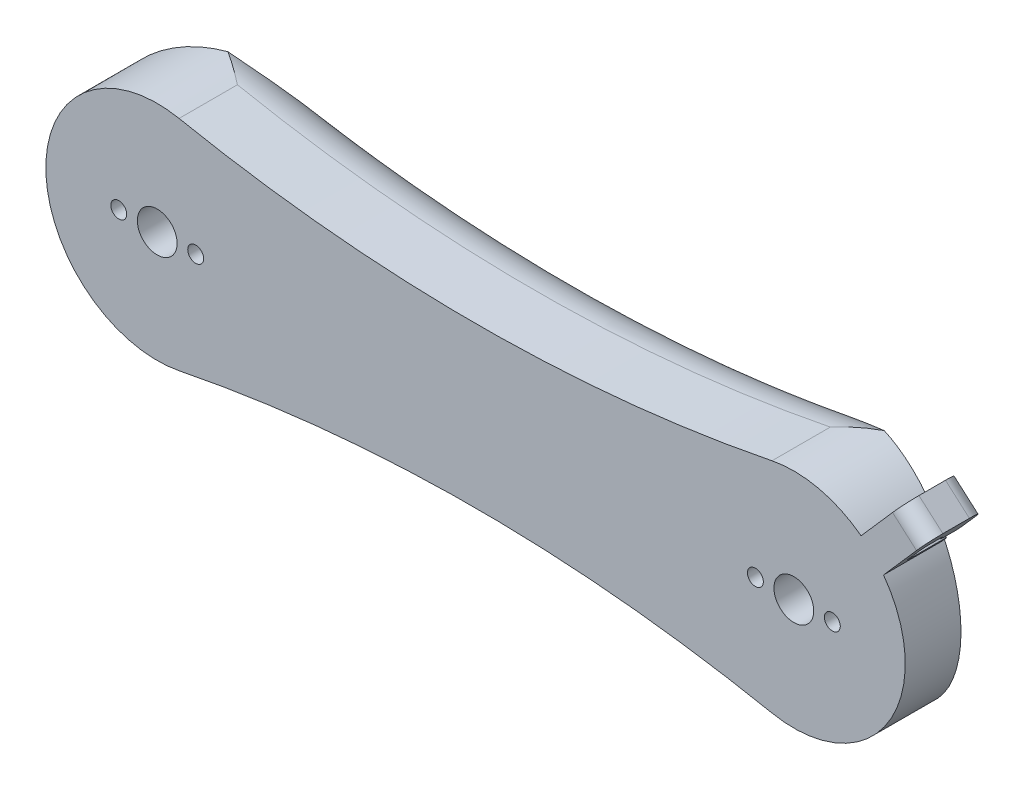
ISO-10303-21;
HEADER;
FILE_DESCRIPTION(('STEP AP214'),'2;1');
FILE_NAME('part.step','',(''),(''),'','','');
FILE_SCHEMA(('AUTOMOTIVE_DESIGN { 1 0 10303 214 1 1 1 1 }'));
ENDSEC;
DATA;
#1=APPLICATION_CONTEXT('core data for automotive mechanical design processes');
#2=APPLICATION_PROTOCOL_DEFINITION('international standard','automotive_design',2000,#1);
#3=PRODUCT_CONTEXT('',#1,'mechanical');
#4=PRODUCT('Part','Part','',(#3));
#5=PRODUCT_RELATED_PRODUCT_CATEGORY('part','',(#4));
#6=PRODUCT_DEFINITION_FORMATION('','',#4);
#7=PRODUCT_DEFINITION_CONTEXT('part definition',#1,'design');
#8=PRODUCT_DEFINITION('design','',#6,#7);
#9=PRODUCT_DEFINITION_SHAPE('','',#8);
#10=(LENGTH_UNIT() NAMED_UNIT(*) SI_UNIT(.MILLI.,.METRE.));
#11=(NAMED_UNIT(*) PLANE_ANGLE_UNIT() SI_UNIT($,.RADIAN.));
#12=(NAMED_UNIT(*) SI_UNIT($,.STERADIAN.) SOLID_ANGLE_UNIT());
#13=UNCERTAINTY_MEASURE_WITH_UNIT(LENGTH_MEASURE(1.E-05),#10,'distance_accuracy_value','');
#14=(GEOMETRIC_REPRESENTATION_CONTEXT(3) GLOBAL_UNCERTAINTY_ASSIGNED_CONTEXT((#13)) GLOBAL_UNIT_ASSIGNED_CONTEXT((#10,
#11,#12)) REPRESENTATION_CONTEXT('',''));
#15=CARTESIAN_POINT('',(0.,0.,0.));
#16=DIRECTION('',(0.,0.,1.));
#17=DIRECTION('',(1.,0.,0.));
#18=AXIS2_PLACEMENT_3D('',#15,#16,#17);
#19=CARTESIAN_POINT('',(60.,0.,10.));
#20=DIRECTION('',(0.,0.,1.));
#21=DIRECTION('',(1.,0.,0.));
#22=AXIS2_PLACEMENT_3D('',#19,#20,#21);
#23=PLANE('',#22);
#24=DIRECTION('',(-0.659258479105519,-0.751916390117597,0.));
#25=VECTOR('',#24,1.);
#26=CARTESIAN_POINT('',(72.6749786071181,16.7435037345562,10.));
#27=LINE('',#26,#25);
#28=CARTESIAN_POINT('',(73.0494988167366,17.1706622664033,10.));
#29=VERTEX_POINT('',#28);
#30=CARTESIAN_POINT('',(72.6749786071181,16.7435037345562,10.));
#31=VERTEX_POINT('',#30);
#32=EDGE_CURVE('E241',#29,#31,#27,.T.);
#33=ORIENTED_EDGE('',*,*,#32,.F.);
#34=DIRECTION('',(0.751916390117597,-0.659258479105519,0.));
#35=VECTOR('',#34,1.);
#36=CARTESIAN_POINT('',(74.1832177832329,16.1766503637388,10.));
#37=LINE('',#36,#35);
#38=CARTESIAN_POINT('',(77.5609971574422,13.2151113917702,10.));
#39=VERTEX_POINT('',#38);
#40=EDGE_CURVE('E219',#29,#39,#37,.T.);
#41=ORIENTED_EDGE('',*,*,#40,.T.);
#42=DIRECTION('',(0.659258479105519,0.751916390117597,0.));
#43=VECTOR('',#42,1.);
#44=CARTESIAN_POINT('',(85.0975786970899,21.8109495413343,10.));
#45=LINE('',#44,#43);
#46=CARTESIAN_POINT('',(76.9017386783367,12.4631950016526,10.));
#47=VERTEX_POINT('',#46);
#48=EDGE_CURVE('E236',#47,#39,#45,.T.);
#49=ORIENTED_EDGE('',*,*,#48,.F.);
#50=CARTESIAN_POINT('',(60.,0.,10.));
#51=DIRECTION('',(0.,0.,-1.));
#52=DIRECTION('',(1.,0.,0.));
#53=AXIS2_PLACEMENT_3D('',#50,#51,#52);
#54=CIRCLE('',#53,21.);
#55=EDGE_CURVE('E237',#31,#47,#54,.T.);
#56=ORIENTED_EDGE('',*,*,#55,.F.);
#57=EDGE_LOOP('',(#33,#41,#49,#56));
#58=FACE_BOUND('',#57,.T.);
#59=ADVANCED_FACE('F45',(#58),#23,.F.);
#60=CARTESIAN_POINT('',(60.,0.,21.));
#61=DIRECTION('',(0.,0.,-1.));
#62=DIRECTION('',(-1.,0.,0.));
#63=AXIS2_PLACEMENT_3D('',#60,#61,#62);
#64=CYLINDRICAL_SURFACE('',#63,3.75000000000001);
#65=CARTESIAN_POINT('',(60.,0.,21.));
#66=DIRECTION('',(0.,0.,1.));
#67=DIRECTION('',(1.,0.,0.));
#68=AXIS2_PLACEMENT_3D('',#65,#66,#67);
#69=CIRCLE('',#68,3.75000000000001);
#70=CARTESIAN_POINT('',(56.25,0.,21.));
#71=VERTEX_POINT('',#70);
#72=EDGE_CURVE('E561',#71,#71,#69,.T.);
#73=CARTESIAN_POINT('',(60.,0.,15.));
#74=DIRECTION('',(0.,0.,-1.));
#75=DIRECTION('',(-1.,0.,0.));
#76=AXIS2_PLACEMENT_3D('',#73,#74,#75);
#77=CIRCLE('',#76,3.75000000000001);
#78=CARTESIAN_POINT('',(56.25,0.,15.));
#79=VERTEX_POINT('',#78);
#80=EDGE_CURVE('E537',#79,#79,#77,.T.);
#81=CARTESIAN_POINT('',(56.25,0.,21.));
#82=CARTESIAN_POINT('',(56.25,0.,20.9375));
#83=CARTESIAN_POINT('',(56.25,0.,20.875));
#84=CARTESIAN_POINT('',(56.25,0.,20.75));
#85=CARTESIAN_POINT('',(56.25,0.,20.6875));
#86=CARTESIAN_POINT('',(56.25,0.,20.5625));
#87=CARTESIAN_POINT('',(56.25,0.,20.5));
#88=CARTESIAN_POINT('',(56.25,0.,20.375));
#89=CARTESIAN_POINT('',(56.25,0.,20.3125));
#90=CARTESIAN_POINT('',(56.25,0.,20.1875));
#91=CARTESIAN_POINT('',(56.25,0.,20.125));
#92=CARTESIAN_POINT('',(56.25,0.,20.));
#93=CARTESIAN_POINT('',(56.25,0.,19.9375));
#94=CARTESIAN_POINT('',(56.25,0.,19.8125));
#95=CARTESIAN_POINT('',(56.25,0.,19.75));
#96=CARTESIAN_POINT('',(56.25,0.,19.625));
#97=CARTESIAN_POINT('',(56.25,0.,19.5625));
#98=CARTESIAN_POINT('',(56.25,0.,19.4375));
#99=CARTESIAN_POINT('',(56.25,0.,19.375));
#100=CARTESIAN_POINT('',(56.25,0.,19.25));
#101=CARTESIAN_POINT('',(56.25,0.,19.1875));
#102=CARTESIAN_POINT('',(56.25,0.,19.0625));
#103=CARTESIAN_POINT('',(56.25,0.,19.));
#104=CARTESIAN_POINT('',(56.25,0.,18.875));
#105=CARTESIAN_POINT('',(56.25,0.,18.8125));
#106=CARTESIAN_POINT('',(56.25,0.,18.6875));
#107=CARTESIAN_POINT('',(56.25,0.,18.625));
#108=CARTESIAN_POINT('',(56.25,0.,18.5));
#109=CARTESIAN_POINT('',(56.25,0.,18.4375));
#110=CARTESIAN_POINT('',(56.25,0.,18.3125));
#111=CARTESIAN_POINT('',(56.25,0.,18.25));
#112=CARTESIAN_POINT('',(56.25,0.,18.125));
#113=CARTESIAN_POINT('',(56.25,0.,18.0625));
#114=CARTESIAN_POINT('',(56.25,0.,17.9375));
#115=CARTESIAN_POINT('',(56.25,0.,17.875));
#116=CARTESIAN_POINT('',(56.25,0.,17.75));
#117=CARTESIAN_POINT('',(56.25,0.,17.6875));
#118=CARTESIAN_POINT('',(56.25,0.,17.5625));
#119=CARTESIAN_POINT('',(56.25,0.,17.5));
#120=CARTESIAN_POINT('',(56.25,0.,17.375));
#121=CARTESIAN_POINT('',(56.25,0.,17.3125));
#122=CARTESIAN_POINT('',(56.25,0.,17.1875));
#123=CARTESIAN_POINT('',(56.25,0.,17.125));
#124=CARTESIAN_POINT('',(56.25,0.,17.));
#125=CARTESIAN_POINT('',(56.25,0.,16.9375));
#126=CARTESIAN_POINT('',(56.25,0.,16.8125));
#127=CARTESIAN_POINT('',(56.25,0.,16.75));
#128=CARTESIAN_POINT('',(56.25,0.,16.625));
#129=CARTESIAN_POINT('',(56.25,0.,16.5625));
#130=CARTESIAN_POINT('',(56.25,0.,16.4375));
#131=CARTESIAN_POINT('',(56.25,0.,16.375));
#132=CARTESIAN_POINT('',(56.25,0.,16.25));
#133=CARTESIAN_POINT('',(56.25,0.,16.1875));
#134=CARTESIAN_POINT('',(56.25,0.,16.0625));
#135=CARTESIAN_POINT('',(56.25,0.,16.));
#136=CARTESIAN_POINT('',(56.25,0.,15.875));
#137=CARTESIAN_POINT('',(56.25,0.,15.8125));
#138=CARTESIAN_POINT('',(56.25,0.,15.6875));
#139=CARTESIAN_POINT('',(56.25,0.,15.625));
#140=CARTESIAN_POINT('',(56.25,0.,15.5));
#141=CARTESIAN_POINT('',(56.25,0.,15.4375));
#142=CARTESIAN_POINT('',(56.25,0.,15.3125));
#143=CARTESIAN_POINT('',(56.25,0.,15.25));
#144=CARTESIAN_POINT('',(56.25,0.,15.125));
#145=CARTESIAN_POINT('',(56.25,0.,15.0625));
#146=CARTESIAN_POINT('',(56.25,0.,15.));
#147=B_SPLINE_CURVE_WITH_KNOTS('',3,(#81,#82,#83,#84,#85,#86,#87,#88,#89,#90,#91,#92,#93,#94,
#95,#96,#97,#98,#99,#100,#101,#102,#103,#104,#105,#106,#107,#108,#109,#110,#111,#112,#113,#114,
#115,#116,#117,#118,#119,#120,#121,#122,#123,#124,#125,#126,#127,#128,#129,#130,#131,#132,#133,
#134,#135,#136,#137,#138,#139,#140,#141,#142,#143,#144,#145,#146),.UNSPECIFIED.,.F.,.F.,(4,2,2,
2,2,2,2,2,2,2,2,2,2,2,2,2,2,2,2,2,2,2,2,2,2,2,2,2,2,2,2,2,4),(0.,0.187499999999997,
0.374999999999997,0.562499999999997,0.749999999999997,0.937499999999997,1.125,1.3125,1.5,1.6875,
1.875,2.0625,2.25,2.4375,2.625,2.8125,3.,3.1875,3.375,3.5625,3.75,3.9375,4.125,4.3125,4.5,
4.6875,4.875,5.0625,5.25,5.4375,5.625,5.8125,6.),.UNSPECIFIED.);
#148=EDGE_CURVE('BSEAM342',#71,#79,#147,.T.);
#149=ORIENTED_EDGE('',*,*,#72,.T.);
#150=ORIENTED_EDGE('',*,*,#80,.T.);
#151=ORIENTED_EDGE('',*,*,#148,.T.);
#152=ORIENTED_EDGE('',*,*,#148,.F.);
#153=EDGE_LOOP('',(#149,#151,#150,#152));
#154=FACE_BOUND('',#153,.T.);
#155=ADVANCED_FACE('F342',(#154),#64,.F.);
#156=CARTESIAN_POINT('',(67.25,0.,21.));
#157=DIRECTION('',(0.,0.,-1.));
#158=DIRECTION('',(-1.,0.,0.));
#159=AXIS2_PLACEMENT_3D('',#156,#157,#158);
#160=CYLINDRICAL_SURFACE('',#159,1.5);
#161=CARTESIAN_POINT('',(67.25,0.,21.));
#162=DIRECTION('',(0.,0.,1.));
#163=DIRECTION('',(1.,0.,0.));
#164=AXIS2_PLACEMENT_3D('',#161,#162,#163);
#165=CIRCLE('',#164,1.5);
#166=CARTESIAN_POINT('',(65.75,0.,21.));
#167=VERTEX_POINT('',#166);
#168=EDGE_CURVE('E557',#167,#167,#165,.T.);
#169=CARTESIAN_POINT('',(67.25,0.,15.));
#170=DIRECTION('',(0.,0.,-1.));
#171=DIRECTION('',(-1.,0.,0.));
#172=AXIS2_PLACEMENT_3D('',#169,#170,#171);
#173=CIRCLE('',#172,1.5);
#174=CARTESIAN_POINT('',(65.75,0.,15.));
#175=VERTEX_POINT('',#174);
#176=EDGE_CURVE('E533',#175,#175,#173,.T.);
#177=CARTESIAN_POINT('',(65.75,0.,21.));
#178=CARTESIAN_POINT('',(65.75,0.,20.9375));
#179=CARTESIAN_POINT('',(65.75,0.,20.875));
#180=CARTESIAN_POINT('',(65.75,0.,20.75));
#181=CARTESIAN_POINT('',(65.75,0.,20.6875));
#182=CARTESIAN_POINT('',(65.75,0.,20.5625));
#183=CARTESIAN_POINT('',(65.75,0.,20.5));
#184=CARTESIAN_POINT('',(65.75,0.,20.375));
#185=CARTESIAN_POINT('',(65.75,0.,20.3125));
#186=CARTESIAN_POINT('',(65.75,0.,20.1875));
#187=CARTESIAN_POINT('',(65.75,0.,20.125));
#188=CARTESIAN_POINT('',(65.75,0.,20.));
#189=CARTESIAN_POINT('',(65.75,0.,19.9375));
#190=CARTESIAN_POINT('',(65.75,0.,19.8125));
#191=CARTESIAN_POINT('',(65.75,0.,19.75));
#192=CARTESIAN_POINT('',(65.75,0.,19.625));
#193=CARTESIAN_POINT('',(65.75,0.,19.5625));
#194=CARTESIAN_POINT('',(65.75,0.,19.4375));
#195=CARTESIAN_POINT('',(65.75,0.,19.375));
#196=CARTESIAN_POINT('',(65.75,0.,19.25));
#197=CARTESIAN_POINT('',(65.75,0.,19.1875));
#198=CARTESIAN_POINT('',(65.75,0.,19.0625));
#199=CARTESIAN_POINT('',(65.75,0.,19.));
#200=CARTESIAN_POINT('',(65.75,0.,18.875));
#201=CARTESIAN_POINT('',(65.75,0.,18.8125));
#202=CARTESIAN_POINT('',(65.75,0.,18.6875));
#203=CARTESIAN_POINT('',(65.75,0.,18.625));
#204=CARTESIAN_POINT('',(65.75,0.,18.5));
#205=CARTESIAN_POINT('',(65.75,0.,18.4375));
#206=CARTESIAN_POINT('',(65.75,0.,18.3125));
#207=CARTESIAN_POINT('',(65.75,0.,18.25));
#208=CARTESIAN_POINT('',(65.75,0.,18.125));
#209=CARTESIAN_POINT('',(65.75,0.,18.0625));
#210=CARTESIAN_POINT('',(65.75,0.,17.9375));
#211=CARTESIAN_POINT('',(65.75,0.,17.875));
#212=CARTESIAN_POINT('',(65.75,0.,17.75));
#213=CARTESIAN_POINT('',(65.75,0.,17.6875));
#214=CARTESIAN_POINT('',(65.75,0.,17.5625));
#215=CARTESIAN_POINT('',(65.75,0.,17.5));
#216=CARTESIAN_POINT('',(65.75,0.,17.375));
#217=CARTESIAN_POINT('',(65.75,0.,17.3125));
#218=CARTESIAN_POINT('',(65.75,0.,17.1875));
#219=CARTESIAN_POINT('',(65.75,0.,17.125));
#220=CARTESIAN_POINT('',(65.75,0.,17.));
#221=CARTESIAN_POINT('',(65.75,0.,16.9375));
#222=CARTESIAN_POINT('',(65.75,0.,16.8125));
#223=CARTESIAN_POINT('',(65.75,0.,16.75));
#224=CARTESIAN_POINT('',(65.75,0.,16.625));
#225=CARTESIAN_POINT('',(65.75,0.,16.5625));
#226=CARTESIAN_POINT('',(65.75,0.,16.4375));
#227=CARTESIAN_POINT('',(65.75,0.,16.375));
#228=CARTESIAN_POINT('',(65.75,0.,16.25));
#229=CARTESIAN_POINT('',(65.75,0.,16.1875));
#230=CARTESIAN_POINT('',(65.75,0.,16.0625));
#231=CARTESIAN_POINT('',(65.75,0.,16.));
#232=CARTESIAN_POINT('',(65.75,0.,15.875));
#233=CARTESIAN_POINT('',(65.75,0.,15.8125));
#234=CARTESIAN_POINT('',(65.75,0.,15.6875));
#235=CARTESIAN_POINT('',(65.75,0.,15.625));
#236=CARTESIAN_POINT('',(65.75,0.,15.5));
#237=CARTESIAN_POINT('',(65.75,0.,15.4375));
#238=CARTESIAN_POINT('',(65.75,0.,15.3125));
#239=CARTESIAN_POINT('',(65.75,0.,15.25));
#240=CARTESIAN_POINT('',(65.75,0.,15.125));
#241=CARTESIAN_POINT('',(65.75,0.,15.0625));
#242=CARTESIAN_POINT('',(65.75,0.,15.));
#243=B_SPLINE_CURVE_WITH_KNOTS('',3,(#177,#178,#179,#180,#181,#182,#183,#184,#185,#186,#187,
#188,#189,#190,#191,#192,#193,#194,#195,#196,#197,#198,#199,#200,#201,#202,#203,#204,#205,#206,
#207,#208,#209,#210,#211,#212,#213,#214,#215,#216,#217,#218,#219,#220,#221,#222,#223,#224,#225,
#226,#227,#228,#229,#230,#231,#232,#233,#234,#235,#236,#237,#238,#239,#240,#241,#242),
.UNSPECIFIED.,.F.,.F.,(4,2,2,2,2,2,2,2,2,2,2,2,2,2,2,2,2,2,2,2,2,2,2,2,2,2,2,2,2,2,2,2,4),(0.,
0.187499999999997,0.374999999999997,0.562499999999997,0.749999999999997,0.937499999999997,1.125,
1.3125,1.5,1.6875,1.875,2.0625,2.25,2.4375,2.625,2.8125,3.,3.1875,3.375,3.5625,3.75,3.9375,
4.125,4.3125,4.5,4.6875,4.875,5.0625,5.25,5.4375,5.625,5.8125,6.),.UNSPECIFIED.);
#244=EDGE_CURVE('BSEAM348',#167,#175,#243,.T.);
#245=ORIENTED_EDGE('',*,*,#168,.T.);
#246=ORIENTED_EDGE('',*,*,#176,.T.);
#247=ORIENTED_EDGE('',*,*,#244,.T.);
#248=ORIENTED_EDGE('',*,*,#244,.F.);
#249=EDGE_LOOP('',(#245,#247,#246,#248));
#250=FACE_BOUND('',#249,.T.);
#251=ADVANCED_FACE('F348',(#250),#160,.F.);
#252=CARTESIAN_POINT('',(52.75,0.,21.));
#253=DIRECTION('',(0.,0.,-1.));
#254=DIRECTION('',(-1.,0.,0.));
#255=AXIS2_PLACEMENT_3D('',#252,#253,#254);
#256=CYLINDRICAL_SURFACE('',#255,1.5);
#257=CARTESIAN_POINT('',(52.75,0.,21.));
#258=DIRECTION('',(0.,0.,1.));
#259=DIRECTION('',(1.,0.,0.));
#260=AXIS2_PLACEMENT_3D('',#257,#258,#259);
#261=CIRCLE('',#260,1.5);
#262=CARTESIAN_POINT('',(51.25,0.,21.));
#263=VERTEX_POINT('',#262);
#264=EDGE_CURVE('E553',#263,#263,#261,.T.);
#265=CARTESIAN_POINT('',(52.75,0.,15.));
#266=DIRECTION('',(0.,0.,-1.));
#267=DIRECTION('',(-1.,0.,0.));
#268=AXIS2_PLACEMENT_3D('',#265,#266,#267);
#269=CIRCLE('',#268,1.5);
#270=CARTESIAN_POINT('',(51.25,0.,15.));
#271=VERTEX_POINT('',#270);
#272=EDGE_CURVE('E325',#271,#271,#269,.T.);
#273=CARTESIAN_POINT('',(51.25,0.,21.));
#274=CARTESIAN_POINT('',(51.25,0.,20.9375));
#275=CARTESIAN_POINT('',(51.25,0.,20.875));
#276=CARTESIAN_POINT('',(51.25,0.,20.75));
#277=CARTESIAN_POINT('',(51.25,0.,20.6875));
#278=CARTESIAN_POINT('',(51.25,0.,20.5625));
#279=CARTESIAN_POINT('',(51.25,0.,20.5));
#280=CARTESIAN_POINT('',(51.25,0.,20.375));
#281=CARTESIAN_POINT('',(51.25,0.,20.3125));
#282=CARTESIAN_POINT('',(51.25,0.,20.1875));
#283=CARTESIAN_POINT('',(51.25,0.,20.125));
#284=CARTESIAN_POINT('',(51.25,0.,20.));
#285=CARTESIAN_POINT('',(51.25,0.,19.9375));
#286=CARTESIAN_POINT('',(51.25,0.,19.8125));
#287=CARTESIAN_POINT('',(51.25,0.,19.75));
#288=CARTESIAN_POINT('',(51.25,0.,19.625));
#289=CARTESIAN_POINT('',(51.25,0.,19.5625));
#290=CARTESIAN_POINT('',(51.25,0.,19.4375));
#291=CARTESIAN_POINT('',(51.25,0.,19.375));
#292=CARTESIAN_POINT('',(51.25,0.,19.25));
#293=CARTESIAN_POINT('',(51.25,0.,19.1875));
#294=CARTESIAN_POINT('',(51.25,0.,19.0625));
#295=CARTESIAN_POINT('',(51.25,0.,19.));
#296=CARTESIAN_POINT('',(51.25,0.,18.875));
#297=CARTESIAN_POINT('',(51.25,0.,18.8125));
#298=CARTESIAN_POINT('',(51.25,0.,18.6875));
#299=CARTESIAN_POINT('',(51.25,0.,18.625));
#300=CARTESIAN_POINT('',(51.25,0.,18.5));
#301=CARTESIAN_POINT('',(51.25,0.,18.4375));
#302=CARTESIAN_POINT('',(51.25,0.,18.3125));
#303=CARTESIAN_POINT('',(51.25,0.,18.25));
#304=CARTESIAN_POINT('',(51.25,0.,18.125));
#305=CARTESIAN_POINT('',(51.25,0.,18.0625));
#306=CARTESIAN_POINT('',(51.25,0.,17.9375));
#307=CARTESIAN_POINT('',(51.25,0.,17.875));
#308=CARTESIAN_POINT('',(51.25,0.,17.75));
#309=CARTESIAN_POINT('',(51.25,0.,17.6875));
#310=CARTESIAN_POINT('',(51.25,0.,17.5625));
#311=CARTESIAN_POINT('',(51.25,0.,17.5));
#312=CARTESIAN_POINT('',(51.25,0.,17.375));
#313=CARTESIAN_POINT('',(51.25,0.,17.3125));
#314=CARTESIAN_POINT('',(51.25,0.,17.1875));
#315=CARTESIAN_POINT('',(51.25,0.,17.125));
#316=CARTESIAN_POINT('',(51.25,0.,17.));
#317=CARTESIAN_POINT('',(51.25,0.,16.9375));
#318=CARTESIAN_POINT('',(51.25,0.,16.8125));
#319=CARTESIAN_POINT('',(51.25,0.,16.75));
#320=CARTESIAN_POINT('',(51.25,0.,16.625));
#321=CARTESIAN_POINT('',(51.25,0.,16.5625));
#322=CARTESIAN_POINT('',(51.25,0.,16.4375));
#323=CARTESIAN_POINT('',(51.25,0.,16.375));
#324=CARTESIAN_POINT('',(51.25,0.,16.25));
#325=CARTESIAN_POINT('',(51.25,0.,16.1875));
#326=CARTESIAN_POINT('',(51.25,0.,16.0625));
#327=CARTESIAN_POINT('',(51.25,0.,16.));
#328=CARTESIAN_POINT('',(51.25,0.,15.875));
#329=CARTESIAN_POINT('',(51.25,0.,15.8125));
#330=CARTESIAN_POINT('',(51.25,0.,15.6875));
#331=CARTESIAN_POINT('',(51.25,0.,15.625));
#332=CARTESIAN_POINT('',(51.25,0.,15.5));
#333=CARTESIAN_POINT('',(51.25,0.,15.4375));
#334=CARTESIAN_POINT('',(51.25,0.,15.3125));
#335=CARTESIAN_POINT('',(51.25,0.,15.25));
#336=CARTESIAN_POINT('',(51.25,0.,15.125));
#337=CARTESIAN_POINT('',(51.25,0.,15.0625));
#338=CARTESIAN_POINT('',(51.25,0.,15.));
#339=B_SPLINE_CURVE_WITH_KNOTS('',3,(#273,#274,#275,#276,#277,#278,#279,#280,#281,#282,#283,
#284,#285,#286,#287,#288,#289,#290,#291,#292,#293,#294,#295,#296,#297,#298,#299,#300,#301,#302,
#303,#304,#305,#306,#307,#308,#309,#310,#311,#312,#313,#314,#315,#316,#317,#318,#319,#320,#321,
#322,#323,#324,#325,#326,#327,#328,#329,#330,#331,#332,#333,#334,#335,#336,#337,#338),
.UNSPECIFIED.,.F.,.F.,(4,2,2,2,2,2,2,2,2,2,2,2,2,2,2,2,2,2,2,2,2,2,2,2,2,2,2,2,2,2,2,2,4),(0.,
0.187499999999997,0.374999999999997,0.562499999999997,0.749999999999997,0.937499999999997,1.125,
1.3125,1.5,1.6875,1.875,2.0625,2.25,2.4375,2.625,2.8125,3.,3.1875,3.375,3.5625,3.75,3.9375,
4.125,4.3125,4.5,4.6875,4.875,5.0625,5.25,5.4375,5.625,5.8125,6.),.UNSPECIFIED.);
#340=EDGE_CURVE('BSEAM650',#263,#271,#339,.T.);
#341=ORIENTED_EDGE('',*,*,#264,.T.);
#342=ORIENTED_EDGE('',*,*,#272,.T.);
#343=ORIENTED_EDGE('',*,*,#340,.T.);
#344=ORIENTED_EDGE('',*,*,#340,.F.);
#345=EDGE_LOOP('',(#341,#343,#342,#344));
#346=FACE_BOUND('',#345,.T.);
#347=ADVANCED_FACE('F650',(#346),#256,.F.);
#348=CARTESIAN_POINT('',(-67.25,0.,21.));
#349=DIRECTION('',(0.,0.,-1.));
#350=DIRECTION('',(-1.,0.,0.));
#351=AXIS2_PLACEMENT_3D('',#348,#349,#350);
#352=CYLINDRICAL_SURFACE('',#351,1.5);
#353=CARTESIAN_POINT('',(-67.25,0.,21.));
#354=DIRECTION('',(0.,0.,1.));
#355=DIRECTION('',(-1.,0.,0.));
#356=AXIS2_PLACEMENT_3D('',#353,#354,#355);
#357=CIRCLE('',#356,1.5);
#358=CARTESIAN_POINT('',(-68.75,0.,21.));
#359=VERTEX_POINT('',#358);
#360=EDGE_CURVE('E549',#359,#359,#357,.T.);
#361=CARTESIAN_POINT('',(-67.25,0.,15.));
#362=DIRECTION('',(0.,0.,-1.));
#363=DIRECTION('',(-1.,0.,0.));
#364=AXIS2_PLACEMENT_3D('',#361,#362,#363);
#365=CIRCLE('',#364,1.5);
#366=CARTESIAN_POINT('',(-68.75,0.,15.));
#367=VERTEX_POINT('',#366);
#368=EDGE_CURVE('E520',#367,#367,#365,.T.);
#369=CARTESIAN_POINT('',(-68.75,0.,21.));
#370=CARTESIAN_POINT('',(-68.75,0.,20.9375));
#371=CARTESIAN_POINT('',(-68.75,0.,20.875));
#372=CARTESIAN_POINT('',(-68.75,0.,20.75));
#373=CARTESIAN_POINT('',(-68.75,0.,20.6875));
#374=CARTESIAN_POINT('',(-68.75,0.,20.5625));
#375=CARTESIAN_POINT('',(-68.75,0.,20.5));
#376=CARTESIAN_POINT('',(-68.75,0.,20.375));
#377=CARTESIAN_POINT('',(-68.75,0.,20.3125));
#378=CARTESIAN_POINT('',(-68.75,0.,20.1875));
#379=CARTESIAN_POINT('',(-68.75,0.,20.125));
#380=CARTESIAN_POINT('',(-68.75,0.,20.));
#381=CARTESIAN_POINT('',(-68.75,0.,19.9375));
#382=CARTESIAN_POINT('',(-68.75,0.,19.8125));
#383=CARTESIAN_POINT('',(-68.75,0.,19.75));
#384=CARTESIAN_POINT('',(-68.75,0.,19.625));
#385=CARTESIAN_POINT('',(-68.75,0.,19.5625));
#386=CARTESIAN_POINT('',(-68.75,0.,19.4375));
#387=CARTESIAN_POINT('',(-68.75,0.,19.375));
#388=CARTESIAN_POINT('',(-68.75,0.,19.25));
#389=CARTESIAN_POINT('',(-68.75,0.,19.1875));
#390=CARTESIAN_POINT('',(-68.75,0.,19.0625));
#391=CARTESIAN_POINT('',(-68.75,0.,19.));
#392=CARTESIAN_POINT('',(-68.75,0.,18.875));
#393=CARTESIAN_POINT('',(-68.75,0.,18.8125));
#394=CARTESIAN_POINT('',(-68.75,0.,18.6875));
#395=CARTESIAN_POINT('',(-68.75,0.,18.625));
#396=CARTESIAN_POINT('',(-68.75,0.,18.5));
#397=CARTESIAN_POINT('',(-68.75,0.,18.4375));
#398=CARTESIAN_POINT('',(-68.75,0.,18.3125));
#399=CARTESIAN_POINT('',(-68.75,0.,18.25));
#400=CARTESIAN_POINT('',(-68.75,0.,18.125));
#401=CARTESIAN_POINT('',(-68.75,0.,18.0625));
#402=CARTESIAN_POINT('',(-68.75,0.,17.9375));
#403=CARTESIAN_POINT('',(-68.75,0.,17.875));
#404=CARTESIAN_POINT('',(-68.75,0.,17.75));
#405=CARTESIAN_POINT('',(-68.75,0.,17.6875));
#406=CARTESIAN_POINT('',(-68.75,0.,17.5625));
#407=CARTESIAN_POINT('',(-68.75,0.,17.5));
#408=CARTESIAN_POINT('',(-68.75,0.,17.375));
#409=CARTESIAN_POINT('',(-68.75,0.,17.3125));
#410=CARTESIAN_POINT('',(-68.75,0.,17.1875));
#411=CARTESIAN_POINT('',(-68.75,0.,17.125));
#412=CARTESIAN_POINT('',(-68.75,0.,17.));
#413=CARTESIAN_POINT('',(-68.75,0.,16.9375));
#414=CARTESIAN_POINT('',(-68.75,0.,16.8125));
#415=CARTESIAN_POINT('',(-68.75,0.,16.75));
#416=CARTESIAN_POINT('',(-68.75,0.,16.625));
#417=CARTESIAN_POINT('',(-68.75,0.,16.5625));
#418=CARTESIAN_POINT('',(-68.75,0.,16.4375));
#419=CARTESIAN_POINT('',(-68.75,0.,16.375));
#420=CARTESIAN_POINT('',(-68.75,0.,16.25));
#421=CARTESIAN_POINT('',(-68.75,0.,16.1875));
#422=CARTESIAN_POINT('',(-68.75,0.,16.0625));
#423=CARTESIAN_POINT('',(-68.75,0.,16.));
#424=CARTESIAN_POINT('',(-68.75,0.,15.875));
#425=CARTESIAN_POINT('',(-68.75,0.,15.8125));
#426=CARTESIAN_POINT('',(-68.75,0.,15.6875));
#427=CARTESIAN_POINT('',(-68.75,0.,15.625));
#428=CARTESIAN_POINT('',(-68.75,0.,15.5));
#429=CARTESIAN_POINT('',(-68.75,0.,15.4375));
#430=CARTESIAN_POINT('',(-68.75,0.,15.3125));
#431=CARTESIAN_POINT('',(-68.75,0.,15.25));
#432=CARTESIAN_POINT('',(-68.75,0.,15.125));
#433=CARTESIAN_POINT('',(-68.75,0.,15.0625));
#434=CARTESIAN_POINT('',(-68.75,0.,15.));
#435=B_SPLINE_CURVE_WITH_KNOTS('',3,(#369,#370,#371,#372,#373,#374,#375,#376,#377,#378,#379,
#380,#381,#382,#383,#384,#385,#386,#387,#388,#389,#390,#391,#392,#393,#394,#395,#396,#397,#398,
#399,#400,#401,#402,#403,#404,#405,#406,#407,#408,#409,#410,#411,#412,#413,#414,#415,#416,#417,
#418,#419,#420,#421,#422,#423,#424,#425,#426,#427,#428,#429,#430,#431,#432,#433,#434),
.UNSPECIFIED.,.F.,.F.,(4,2,2,2,2,2,2,2,2,2,2,2,2,2,2,2,2,2,2,2,2,2,2,2,2,2,2,2,2,2,2,2,4),(0.,
0.187499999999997,0.374999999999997,0.562499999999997,0.749999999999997,0.937499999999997,1.125,
1.3125,1.5,1.6875,1.875,2.0625,2.25,2.4375,2.625,2.8125,3.,3.1875,3.375,3.5625,3.75,3.9375,
4.125,4.3125,4.5,4.6875,4.875,5.0625,5.25,5.4375,5.625,5.8125,6.),.UNSPECIFIED.);
#436=EDGE_CURVE('BSEAM653',#359,#367,#435,.T.);
#437=ORIENTED_EDGE('',*,*,#360,.T.);
#438=ORIENTED_EDGE('',*,*,#368,.T.);
#439=ORIENTED_EDGE('',*,*,#436,.T.);
#440=ORIENTED_EDGE('',*,*,#436,.F.);
#441=EDGE_LOOP('',(#437,#439,#438,#440));
#442=FACE_BOUND('',#441,.T.);
#443=ADVANCED_FACE('F653',(#442),#352,.F.);
#444=CARTESIAN_POINT('',(-60.,0.,21.));
#445=DIRECTION('',(0.,0.,-1.));
#446=DIRECTION('',(-1.,0.,0.));
#447=AXIS2_PLACEMENT_3D('',#444,#445,#446);
#448=CYLINDRICAL_SURFACE('',#447,3.75);
#449=CARTESIAN_POINT('',(-60.,0.,21.));
#450=DIRECTION('',(0.,0.,1.));
#451=DIRECTION('',(-1.,0.,0.));
#452=AXIS2_PLACEMENT_3D('',#449,#450,#451);
#453=CIRCLE('',#452,3.75);
#454=CARTESIAN_POINT('',(-63.75,0.,21.));
#455=VERTEX_POINT('',#454);
#456=EDGE_CURVE('E545',#455,#455,#453,.T.);
#457=CARTESIAN_POINT('',(-60.,0.,15.));
#458=DIRECTION('',(0.,0.,-1.));
#459=DIRECTION('',(-1.,0.,0.));
#460=AXIS2_PLACEMENT_3D('',#457,#458,#459);
#461=CIRCLE('',#460,3.75);
#462=CARTESIAN_POINT('',(-63.75,0.,15.));
#463=VERTEX_POINT('',#462);
#464=EDGE_CURVE('E514',#463,#463,#461,.T.);
#465=CARTESIAN_POINT('',(-63.75,0.,21.));
#466=CARTESIAN_POINT('',(-63.75,0.,20.9375));
#467=CARTESIAN_POINT('',(-63.75,0.,20.875));
#468=CARTESIAN_POINT('',(-63.75,0.,20.75));
#469=CARTESIAN_POINT('',(-63.75,0.,20.6875));
#470=CARTESIAN_POINT('',(-63.75,0.,20.5625));
#471=CARTESIAN_POINT('',(-63.75,0.,20.5));
#472=CARTESIAN_POINT('',(-63.75,0.,20.375));
#473=CARTESIAN_POINT('',(-63.75,0.,20.3125));
#474=CARTESIAN_POINT('',(-63.75,0.,20.1875));
#475=CARTESIAN_POINT('',(-63.75,0.,20.125));
#476=CARTESIAN_POINT('',(-63.75,0.,20.));
#477=CARTESIAN_POINT('',(-63.75,0.,19.9375));
#478=CARTESIAN_POINT('',(-63.75,0.,19.8125));
#479=CARTESIAN_POINT('',(-63.75,0.,19.75));
#480=CARTESIAN_POINT('',(-63.75,0.,19.625));
#481=CARTESIAN_POINT('',(-63.75,0.,19.5625));
#482=CARTESIAN_POINT('',(-63.75,0.,19.4375));
#483=CARTESIAN_POINT('',(-63.75,0.,19.375));
#484=CARTESIAN_POINT('',(-63.75,0.,19.25));
#485=CARTESIAN_POINT('',(-63.75,0.,19.1875));
#486=CARTESIAN_POINT('',(-63.75,0.,19.0625));
#487=CARTESIAN_POINT('',(-63.75,0.,19.));
#488=CARTESIAN_POINT('',(-63.75,0.,18.875));
#489=CARTESIAN_POINT('',(-63.75,0.,18.8125));
#490=CARTESIAN_POINT('',(-63.75,0.,18.6875));
#491=CARTESIAN_POINT('',(-63.75,0.,18.625));
#492=CARTESIAN_POINT('',(-63.75,0.,18.5));
#493=CARTESIAN_POINT('',(-63.75,0.,18.4375));
#494=CARTESIAN_POINT('',(-63.75,0.,18.3125));
#495=CARTESIAN_POINT('',(-63.75,0.,18.25));
#496=CARTESIAN_POINT('',(-63.75,0.,18.125));
#497=CARTESIAN_POINT('',(-63.75,0.,18.0625));
#498=CARTESIAN_POINT('',(-63.75,0.,17.9375));
#499=CARTESIAN_POINT('',(-63.75,0.,17.875));
#500=CARTESIAN_POINT('',(-63.75,0.,17.75));
#501=CARTESIAN_POINT('',(-63.75,0.,17.6875));
#502=CARTESIAN_POINT('',(-63.75,0.,17.5625));
#503=CARTESIAN_POINT('',(-63.75,0.,17.5));
#504=CARTESIAN_POINT('',(-63.75,0.,17.375));
#505=CARTESIAN_POINT('',(-63.75,0.,17.3125));
#506=CARTESIAN_POINT('',(-63.75,0.,17.1875));
#507=CARTESIAN_POINT('',(-63.75,0.,17.125));
#508=CARTESIAN_POINT('',(-63.75,0.,17.));
#509=CARTESIAN_POINT('',(-63.75,0.,16.9375));
#510=CARTESIAN_POINT('',(-63.75,0.,16.8125));
#511=CARTESIAN_POINT('',(-63.75,0.,16.75));
#512=CARTESIAN_POINT('',(-63.75,0.,16.625));
#513=CARTESIAN_POINT('',(-63.75,0.,16.5625));
#514=CARTESIAN_POINT('',(-63.75,0.,16.4375));
#515=CARTESIAN_POINT('',(-63.75,0.,16.375));
#516=CARTESIAN_POINT('',(-63.75,0.,16.25));
#517=CARTESIAN_POINT('',(-63.75,0.,16.1875));
#518=CARTESIAN_POINT('',(-63.75,0.,16.0625));
#519=CARTESIAN_POINT('',(-63.75,0.,16.));
#520=CARTESIAN_POINT('',(-63.75,0.,15.875));
#521=CARTESIAN_POINT('',(-63.75,0.,15.8125));
#522=CARTESIAN_POINT('',(-63.75,0.,15.6875));
#523=CARTESIAN_POINT('',(-63.75,0.,15.625));
#524=CARTESIAN_POINT('',(-63.75,0.,15.5));
#525=CARTESIAN_POINT('',(-63.75,0.,15.4375));
#526=CARTESIAN_POINT('',(-63.75,0.,15.3125));
#527=CARTESIAN_POINT('',(-63.75,0.,15.25));
#528=CARTESIAN_POINT('',(-63.75,0.,15.125));
#529=CARTESIAN_POINT('',(-63.75,0.,15.0625));
#530=CARTESIAN_POINT('',(-63.75,0.,15.));
#531=B_SPLINE_CURVE_WITH_KNOTS('',3,(#465,#466,#467,#468,#469,#470,#471,#472,#473,#474,#475,
#476,#477,#478,#479,#480,#481,#482,#483,#484,#485,#486,#487,#488,#489,#490,#491,#492,#493,#494,
#495,#496,#497,#498,#499,#500,#501,#502,#503,#504,#505,#506,#507,#508,#509,#510,#511,#512,#513,
#514,#515,#516,#517,#518,#519,#520,#521,#522,#523,#524,#525,#526,#527,#528,#529,#530),
.UNSPECIFIED.,.F.,.F.,(4,2,2,2,2,2,2,2,2,2,2,2,2,2,2,2,2,2,2,2,2,2,2,2,2,2,2,2,2,2,2,2,4),(0.,
0.187499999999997,0.374999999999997,0.562499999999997,0.749999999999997,0.937499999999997,1.125,
1.3125,1.5,1.6875,1.875,2.0625,2.25,2.4375,2.625,2.8125,3.,3.1875,3.375,3.5625,3.75,3.9375,
4.125,4.3125,4.5,4.6875,4.875,5.0625,5.25,5.4375,5.625,5.8125,6.),.UNSPECIFIED.);
#532=EDGE_CURVE('BSEAM660',#455,#463,#531,.T.);
#533=ORIENTED_EDGE('',*,*,#456,.T.);
#534=ORIENTED_EDGE('',*,*,#464,.T.);
#535=ORIENTED_EDGE('',*,*,#532,.T.);
#536=ORIENTED_EDGE('',*,*,#532,.F.);
#537=EDGE_LOOP('',(#533,#535,#534,#536));
#538=FACE_BOUND('',#537,.T.);
#539=ADVANCED_FACE('F660',(#538),#448,.F.);
#540=CARTESIAN_POINT('',(-52.75,0.,21.));
#541=DIRECTION('',(0.,0.,-1.));
#542=DIRECTION('',(-1.,0.,0.));
#543=AXIS2_PLACEMENT_3D('',#540,#541,#542);
#544=CYLINDRICAL_SURFACE('',#543,1.5);
#545=CARTESIAN_POINT('',(-52.75,0.,21.));
#546=DIRECTION('',(0.,0.,1.));
#547=DIRECTION('',(-1.,0.,0.));
#548=AXIS2_PLACEMENT_3D('',#545,#546,#547);
#549=CIRCLE('',#548,1.5);
#550=CARTESIAN_POINT('',(-54.25,0.,21.));
#551=VERTEX_POINT('',#550);
#552=EDGE_CURVE('E541',#551,#551,#549,.T.);
#553=CARTESIAN_POINT('',(-52.75,0.,15.));
#554=DIRECTION('',(0.,0.,-1.));
#555=DIRECTION('',(-1.,0.,0.));
#556=AXIS2_PLACEMENT_3D('',#553,#554,#555);
#557=CIRCLE('',#556,1.5);
#558=CARTESIAN_POINT('',(-54.25,0.,15.));
#559=VERTEX_POINT('',#558);
#560=EDGE_CURVE('E511',#559,#559,#557,.T.);
#561=CARTESIAN_POINT('',(-54.25,0.,21.));
#562=CARTESIAN_POINT('',(-54.25,0.,20.9375));
#563=CARTESIAN_POINT('',(-54.25,0.,20.875));
#564=CARTESIAN_POINT('',(-54.25,0.,20.75));
#565=CARTESIAN_POINT('',(-54.25,0.,20.6875));
#566=CARTESIAN_POINT('',(-54.25,0.,20.5625));
#567=CARTESIAN_POINT('',(-54.25,0.,20.5));
#568=CARTESIAN_POINT('',(-54.25,0.,20.375));
#569=CARTESIAN_POINT('',(-54.25,0.,20.3125));
#570=CARTESIAN_POINT('',(-54.25,0.,20.1875));
#571=CARTESIAN_POINT('',(-54.25,0.,20.125));
#572=CARTESIAN_POINT('',(-54.25,0.,20.));
#573=CARTESIAN_POINT('',(-54.25,0.,19.9375));
#574=CARTESIAN_POINT('',(-54.25,0.,19.8125));
#575=CARTESIAN_POINT('',(-54.25,0.,19.75));
#576=CARTESIAN_POINT('',(-54.25,0.,19.625));
#577=CARTESIAN_POINT('',(-54.25,0.,19.5625));
#578=CARTESIAN_POINT('',(-54.25,0.,19.4375));
#579=CARTESIAN_POINT('',(-54.25,0.,19.375));
#580=CARTESIAN_POINT('',(-54.25,0.,19.25));
#581=CARTESIAN_POINT('',(-54.25,0.,19.1875));
#582=CARTESIAN_POINT('',(-54.25,0.,19.0625));
#583=CARTESIAN_POINT('',(-54.25,0.,19.));
#584=CARTESIAN_POINT('',(-54.25,0.,18.875));
#585=CARTESIAN_POINT('',(-54.25,0.,18.8125));
#586=CARTESIAN_POINT('',(-54.25,0.,18.6875));
#587=CARTESIAN_POINT('',(-54.25,0.,18.625));
#588=CARTESIAN_POINT('',(-54.25,0.,18.5));
#589=CARTESIAN_POINT('',(-54.25,0.,18.4375));
#590=CARTESIAN_POINT('',(-54.25,0.,18.3125));
#591=CARTESIAN_POINT('',(-54.25,0.,18.25));
#592=CARTESIAN_POINT('',(-54.25,0.,18.125));
#593=CARTESIAN_POINT('',(-54.25,0.,18.0625));
#594=CARTESIAN_POINT('',(-54.25,0.,17.9375));
#595=CARTESIAN_POINT('',(-54.25,0.,17.875));
#596=CARTESIAN_POINT('',(-54.25,0.,17.75));
#597=CARTESIAN_POINT('',(-54.25,0.,17.6875));
#598=CARTESIAN_POINT('',(-54.25,0.,17.5625));
#599=CARTESIAN_POINT('',(-54.25,0.,17.5));
#600=CARTESIAN_POINT('',(-54.25,0.,17.375));
#601=CARTESIAN_POINT('',(-54.25,0.,17.3125));
#602=CARTESIAN_POINT('',(-54.25,0.,17.1875));
#603=CARTESIAN_POINT('',(-54.25,0.,17.125));
#604=CARTESIAN_POINT('',(-54.25,0.,17.));
#605=CARTESIAN_POINT('',(-54.25,0.,16.9375));
#606=CARTESIAN_POINT('',(-54.25,0.,16.8125));
#607=CARTESIAN_POINT('',(-54.25,0.,16.75));
#608=CARTESIAN_POINT('',(-54.25,0.,16.625));
#609=CARTESIAN_POINT('',(-54.25,0.,16.5625));
#610=CARTESIAN_POINT('',(-54.25,0.,16.4375));
#611=CARTESIAN_POINT('',(-54.25,0.,16.375));
#612=CARTESIAN_POINT('',(-54.25,0.,16.25));
#613=CARTESIAN_POINT('',(-54.25,0.,16.1875));
#614=CARTESIAN_POINT('',(-54.25,0.,16.0625));
#615=CARTESIAN_POINT('',(-54.25,0.,16.));
#616=CARTESIAN_POINT('',(-54.25,0.,15.875));
#617=CARTESIAN_POINT('',(-54.25,0.,15.8125));
#618=CARTESIAN_POINT('',(-54.25,0.,15.6875));
#619=CARTESIAN_POINT('',(-54.25,0.,15.625));
#620=CARTESIAN_POINT('',(-54.25,0.,15.5));
#621=CARTESIAN_POINT('',(-54.25,0.,15.4375));
#622=CARTESIAN_POINT('',(-54.25,0.,15.3125));
#623=CARTESIAN_POINT('',(-54.25,0.,15.25));
#624=CARTESIAN_POINT('',(-54.25,0.,15.125));
#625=CARTESIAN_POINT('',(-54.25,0.,15.0625));
#626=CARTESIAN_POINT('',(-54.25,0.,15.));
#627=B_SPLINE_CURVE_WITH_KNOTS('',3,(#561,#562,#563,#564,#565,#566,#567,#568,#569,#570,#571,
#572,#573,#574,#575,#576,#577,#578,#579,#580,#581,#582,#583,#584,#585,#586,#587,#588,#589,#590,
#591,#592,#593,#594,#595,#596,#597,#598,#599,#600,#601,#602,#603,#604,#605,#606,#607,#608,#609,
#610,#611,#612,#613,#614,#615,#616,#617,#618,#619,#620,#621,#622,#623,#624,#625,#626),
.UNSPECIFIED.,.F.,.F.,(4,2,2,2,2,2,2,2,2,2,2,2,2,2,2,2,2,2,2,2,2,2,2,2,2,2,2,2,2,2,2,2,4),(0.,
0.187499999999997,0.374999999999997,0.562499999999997,0.749999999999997,0.937499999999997,1.125,
1.3125,1.5,1.6875,1.875,2.0625,2.25,2.4375,2.625,2.8125,3.,3.1875,3.375,3.5625,3.75,3.9375,
4.125,4.3125,4.5,4.6875,4.875,5.0625,5.25,5.4375,5.625,5.8125,6.),.UNSPECIFIED.);
#628=EDGE_CURVE('BSEAM667',#551,#559,#627,.T.);
#629=ORIENTED_EDGE('',*,*,#552,.T.);
#630=ORIENTED_EDGE('',*,*,#560,.T.);
#631=ORIENTED_EDGE('',*,*,#628,.T.);
#632=ORIENTED_EDGE('',*,*,#628,.F.);
#633=EDGE_LOOP('',(#629,#631,#630,#632));
#634=FACE_BOUND('',#633,.T.);
#635=ADVANCED_FACE('F667',(#634),#544,.F.);
#636=CARTESIAN_POINT('',(30.,150.,21.));
#637=DIRECTION('',(0.,0.,1.));
#638=DIRECTION('',(1.,0.,0.));
#639=AXIS2_PLACEMENT_3D('',#636,#637,#638);
#640=PLANE('',#639);
#641=ORIENTED_EDGE('',*,*,#456,.F.);
#642=EDGE_LOOP('',(#641));
#643=FACE_BOUND('',#642,.T.);
#644=ORIENTED_EDGE('',*,*,#264,.F.);
#645=EDGE_LOOP('',(#644));
#646=FACE_BOUND('',#645,.T.);
#647=ORIENTED_EDGE('',*,*,#72,.F.);
#648=EDGE_LOOP('',(#647));
#649=FACE_BOUND('',#648,.T.);
#650=DIRECTION('',(0.659258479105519,0.751916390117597,0.));
#651=VECTOR('',#650,1.);
#652=CARTESIAN_POINT('',(85.0975786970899,21.8109495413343,21.));
#653=LINE('',#652,#651);
#654=CARTESIAN_POINT('',(76.9017386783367,12.4631950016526,21.));
#655=VERTEX_POINT('',#654);
#656=CARTESIAN_POINT('',(83.1198032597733,19.5552003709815,21.));
#657=VERTEX_POINT('',#656);
#658=EDGE_CURVE('E251',#655,#657,#653,.T.);
#659=ORIENTED_EDGE('',*,*,#658,.T.);
#660=DIRECTION('',(-0.751916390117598,0.659258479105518,0.));
#661=VECTOR('',#660,1.);
#662=CARTESIAN_POINT('',(-11.5754122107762,102.581218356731,21.));
#663=LINE('',#662,#661);
#664=CARTESIAN_POINT('',(78.6083049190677,23.5107512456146,21.));
#665=VERTEX_POINT('',#664);
#666=EDGE_CURVE('E591',#657,#665,#663,.T.);
#667=ORIENTED_EDGE('',*,*,#666,.T.);
#668=DIRECTION('',(-0.659258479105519,-0.751916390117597,0.));
#669=VECTOR('',#668,1.);
#670=CARTESIAN_POINT('',(72.6749786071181,16.7435037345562,21.));
#671=LINE('',#670,#669);
#672=CARTESIAN_POINT('',(72.6749786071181,16.7435037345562,21.));
#673=VERTEX_POINT('',#672);
#674=EDGE_CURVE('E243',#665,#673,#671,.T.);
#675=ORIENTED_EDGE('',*,*,#674,.T.);
#676=CARTESIAN_POINT('',(60.,0.,21.));
#677=DIRECTION('',(0.,0.,1.));
#678=DIRECTION('',(1.,0.,0.));
#679=AXIS2_PLACEMENT_3D('',#676,#677,#678);
#680=CIRCLE('',#679,21.);
#681=CARTESIAN_POINT('',(55.8815611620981,20.5921941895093,21.));
#682=VERTEX_POINT('',#681);
#683=EDGE_CURVE('E573',#673,#682,#680,.T.);
#684=ORIENTED_EDGE('',*,*,#683,.T.);
#685=CARTESIAN_POINT('',(0.,300.,21.));
#686=DIRECTION('',(0.,0.,-1.));
#687=DIRECTION('',(1.,0.,0.));
#688=AXIS2_PLACEMENT_3D('',#685,#686,#687);
#689=CIRCLE('',#688,284.941170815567);
#690=CARTESIAN_POINT('',(-55.8815611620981,20.5921941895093,21.));
#691=VERTEX_POINT('',#690);
#692=EDGE_CURVE('E565',#682,#691,#689,.T.);
#693=ORIENTED_EDGE('',*,*,#692,.T.);
#694=CARTESIAN_POINT('',(-60.,0.,21.));
#695=DIRECTION('',(0.,0.,1.));
#696=DIRECTION('',(1.,0.,0.));
#697=AXIS2_PLACEMENT_3D('',#694,#695,#696);
#698=CIRCLE('',#697,21.);
#699=CARTESIAN_POINT('',(-55.8815611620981,-20.5921941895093,21.));
#700=VERTEX_POINT('',#699);
#701=EDGE_CURVE('E499',#691,#700,#698,.T.);
#702=ORIENTED_EDGE('',*,*,#701,.T.);
#703=CARTESIAN_POINT('',(0.,-300.,21.));
#704=DIRECTION('',(0.,0.,-1.));
#705=DIRECTION('',(-1.,0.,0.));
#706=AXIS2_PLACEMENT_3D('',#703,#704,#705);
#707=CIRCLE('',#706,284.941170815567);
#708=CARTESIAN_POINT('',(55.8815611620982,-20.5921941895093,21.));
#709=VERTEX_POINT('',#708);
#710=EDGE_CURVE('E570',#700,#709,#707,.T.);
#711=ORIENTED_EDGE('',*,*,#710,.T.);
#712=EDGE_CURVE('E574',#709,#655,#680,.T.);
#713=ORIENTED_EDGE('',*,*,#712,.T.);
#714=EDGE_LOOP('',(#659,#667,#675,#684,#693,#702,#711,#713));
#715=FACE_BOUND('',#714,.T.);
#716=ORIENTED_EDGE('',*,*,#168,.F.);
#717=EDGE_LOOP('',(#716));
#718=FACE_BOUND('',#717,.T.);
#719=ORIENTED_EDGE('',*,*,#360,.F.);
#720=EDGE_LOOP('',(#719));
#721=FACE_BOUND('',#720,.T.);
#722=ORIENTED_EDGE('',*,*,#552,.F.);
#723=EDGE_LOOP('',(#722));
#724=FACE_BOUND('',#723,.T.);
#725=ADVANCED_FACE('F631',(#643,#646,#649,#715,#718,#721,#724),#640,.T.);
#726=CARTESIAN_POINT('',(30.,150.,0.));
#727=DIRECTION('',(0.,0.,1.));
#728=DIRECTION('',(1.,0.,0.));
#729=AXIS2_PLACEMENT_3D('',#726,#727,#728);
#730=PLANE('',#729);
#731=DIRECTION('',(0.,1.,0.));
#732=VECTOR('',#731,1.);
#733=CARTESIAN_POINT('',(-38.0194053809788,-49.,0.));
#734=LINE('',#733,#732);
#735=CARTESIAN_POINT('',(-38.0194053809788,-7.51954072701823,0.));
#736=VERTEX_POINT('',#735);
#737=CARTESIAN_POINT('',(-38.0194053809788,7.5195407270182,0.));
#738=VERTEX_POINT('',#737);
#739=EDGE_CURVE('E272',#736,#738,#734,.T.);
#740=ORIENTED_EDGE('',*,*,#739,.T.);
#741=CARTESIAN_POINT('',(0.,300.,0.));
#742=DIRECTION('',(0.,0.,1.));
#743=DIRECTION('',(1.,0.,0.));
#744=AXIS2_PLACEMENT_3D('',#741,#742,#743);
#745=CIRCLE('',#744,294.941170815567);
#746=CARTESIAN_POINT('',(38.0194053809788,7.5195407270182,0.));
#747=VERTEX_POINT('',#746);
#748=EDGE_CURVE('E483',#738,#747,#745,.T.);
#749=ORIENTED_EDGE('',*,*,#748,.T.);
#750=DIRECTION('',(0.,1.,0.));
#751=VECTOR('',#750,1.);
#752=CARTESIAN_POINT('',(38.0194053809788,-49.,0.));
#753=LINE('',#752,#751);
#754=CARTESIAN_POINT('',(38.0194053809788,-7.51954072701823,0.));
#755=VERTEX_POINT('',#754);
#756=EDGE_CURVE('E262',#755,#747,#753,.T.);
#757=ORIENTED_EDGE('',*,*,#756,.F.);
#758=CARTESIAN_POINT('',(0.,-300.,0.));
#759=DIRECTION('',(0.,0.,1.));
#760=DIRECTION('',(1.,0.,0.));
#761=AXIS2_PLACEMENT_3D('',#758,#759,#760);
#762=CIRCLE('',#761,294.941170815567);
#763=EDGE_CURVE('E394',#755,#736,#762,.T.);
#764=ORIENTED_EDGE('',*,*,#763,.T.);
#765=EDGE_LOOP('',(#740,#749,#757,#764));
#766=FACE_BOUND('',#765,.T.);
#767=ADVANCED_FACE('F448',(#766),#730,.F.);
#768=CARTESIAN_POINT('',(0.,300.,21.));
#769=DIRECTION('',(0.,0.,-1.));
#770=DIRECTION('',(-1.,0.,0.));
#771=AXIS2_PLACEMENT_3D('',#768,#769,#770);
#772=CYLINDRICAL_SURFACE('',#771,284.941170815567);
#773=DIRECTION('',(0.,0.,-1.));
#774=VECTOR('',#773,1.);
#775=CARTESIAN_POINT('',(55.8815611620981,20.5921941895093,21.));
#776=LINE('',#775,#774);
#777=CARTESIAN_POINT('',(55.8815611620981,20.5921941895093,10.));
#778=VERTEX_POINT('',#777);
#779=EDGE_CURVE('E578',#682,#778,#776,.T.);
#780=ORIENTED_EDGE('',*,*,#779,.T.);
#781=CARTESIAN_POINT('',(0.,300.,10.));
#782=DIRECTION('',(0.,0.,1.));
#783=DIRECTION('',(1.,0.,0.));
#784=AXIS2_PLACEMENT_3D('',#781,#782,#783);
#785=CIRCLE('',#784,284.941170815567);
#786=CARTESIAN_POINT('',(-55.8815611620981,20.5921941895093,10.));
#787=VERTEX_POINT('',#786);
#788=EDGE_CURVE('E465',#778,#787,#785,.F.);
#789=ORIENTED_EDGE('',*,*,#788,.T.);
#790=DIRECTION('',(0.,0.,-1.));
#791=VECTOR('',#790,1.);
#792=CARTESIAN_POINT('',(-55.8815611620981,20.5921941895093,21.));
#793=LINE('',#792,#791);
#794=EDGE_CURVE('E468',#691,#787,#793,.T.);
#795=ORIENTED_EDGE('',*,*,#794,.F.);
#796=ORIENTED_EDGE('',*,*,#692,.F.);
#797=EDGE_LOOP('',(#780,#789,#795,#796));
#798=FACE_BOUND('',#797,.T.);
#799=ADVANCED_FACE('F401',(#798),#772,.F.);
#800=CARTESIAN_POINT('',(-60.,0.,21.));
#801=DIRECTION('',(0.,0.,-1.));
#802=DIRECTION('',(-1.,0.,0.));
#803=AXIS2_PLACEMENT_3D('',#800,#801,#802);
#804=CYLINDRICAL_SURFACE('',#803,21.);
#805=ORIENTED_EDGE('',*,*,#794,.T.);
#806=CARTESIAN_POINT('',(-61.8567876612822,20.9177517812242,5.82338416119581));
#807=CARTESIAN_POINT('',(-61.6031271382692,20.9402639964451,5.99062105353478));
#808=CARTESIAN_POINT('',(-61.3499392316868,20.9580925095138,6.1591563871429));
#809=CARTESIAN_POINT('',(-60.8445996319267,20.9845349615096,6.49846751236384));
#810=CARTESIAN_POINT('',(-60.5924478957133,20.9931492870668,6.66924320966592));
#811=CARTESIAN_POINT('',(-59.837607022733,21.0054031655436,7.18444786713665));
#812=CARTESIAN_POINT('',(-59.3365771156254,20.9954496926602,7.53172468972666));
#813=CARTESIAN_POINT('',(-58.3433147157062,20.9404193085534,8.22869242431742));
#814=CARTESIAN_POINT('',(-57.851045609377,20.8955809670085,8.57835101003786));
#815=CARTESIAN_POINT('',(-56.8726442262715,20.7716789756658,9.2799393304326));
#816=CARTESIAN_POINT('',(-56.3865097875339,20.6926277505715,9.6318681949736));
#817=CARTESIAN_POINT('',(-55.8964355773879,20.5951648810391,9.98915412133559));
#818=CARTESIAN_POINT('',(-55.8889979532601,20.5936815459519,9.99457707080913));
#819=CARTESIAN_POINT('',(-55.8815611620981,20.5921941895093,10.));
#820=B_SPLINE_CURVE_WITH_KNOTS('',3,(#806,#807,#808,#809,#810,#811,#812,#813,#814,#815,#816,
#817,#818,#819),.UNSPECIFIED.,.F.,.F.,(4,2,2,2,2,2,4),(0.,0.913895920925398,1.82775349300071,
3.65563028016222,5.47111534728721,7.2859416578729,7.31391203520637),.UNSPECIFIED.);
#821=CARTESIAN_POINT('',(-61.8567876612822,20.9177517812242,5.82338416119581));
#822=VERTEX_POINT('',#821);
#823=EDGE_CURVE('E406',#787,#822,#820,.F.);
#824=ORIENTED_EDGE('',*,*,#823,.T.);
#825=CARTESIAN_POINT('',(-60.,0.,5.36977781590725));
#826=DIRECTION('',(0.237317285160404,0.,0.971432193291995));
#827=DIRECTION('',(0.971432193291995,0.,-0.237317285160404));
#828=AXIS2_PLACEMENT_3D('',#825,#826,#827);
#829=ELLIPSE('',#828,21.6175664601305,21.);
#830=CARTESIAN_POINT('',(-61.8567876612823,-20.9177517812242,5.82338416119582));
#831=VERTEX_POINT('',#830);
#832=EDGE_CURVE('E285',#822,#831,#829,.T.);
#833=ORIENTED_EDGE('',*,*,#832,.T.);
#834=CARTESIAN_POINT('',(-61.8567876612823,-20.9177517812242,5.82338416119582));
#835=CARTESIAN_POINT('',(-61.6031271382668,-20.9402639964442,5.99062105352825));
#836=CARTESIAN_POINT('',(-61.3499392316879,-20.9580925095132,6.15915638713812));
#837=CARTESIAN_POINT('',(-60.8445996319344,-20.9845349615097,6.49846751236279));
#838=CARTESIAN_POINT('',(-60.5924478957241,-20.9931492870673,6.66924320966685));
#839=CARTESIAN_POINT('',(-59.8376070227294,-21.0054031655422,7.18444786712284));
#840=CARTESIAN_POINT('',(-59.3365771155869,-20.9954496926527,7.5317246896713));
#841=CARTESIAN_POINT('',(-58.3433147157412,-20.9404193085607,8.22869242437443));
#842=CARTESIAN_POINT('',(-57.8510456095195,-20.895580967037,8.57835101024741));
#843=CARTESIAN_POINT('',(-56.8726442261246,-20.7716789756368,9.27993933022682));
#844=CARTESIAN_POINT('',(-56.3865097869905,-20.6926277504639,9.63186819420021));
#845=CARTESIAN_POINT('',(-55.8964355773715,-20.5951648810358,9.98915412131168));
#846=CARTESIAN_POINT('',(-55.8889979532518,-20.5936815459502,9.99457707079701));
#847=CARTESIAN_POINT('',(-55.8815611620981,-20.5921941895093,10.));
#848=B_SPLINE_CURVE_WITH_KNOTS('',3,(#834,#835,#836,#837,#838,#839,#840,#841,#842,#843,#844,
#845,#846,#847),.UNSPECIFIED.,.F.,.F.,(4,2,2,2,2,2,4),(0.,0.913895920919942,1.82775349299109,
3.65563028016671,5.47111534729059,7.28594165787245,7.31391203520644),.UNSPECIFIED.);
#849=CARTESIAN_POINT('',(-55.8815611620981,-20.5921941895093,10.));
#850=VERTEX_POINT('',#849);
#851=EDGE_CURVE('E458',#831,#850,#848,.T.);
#852=ORIENTED_EDGE('',*,*,#851,.T.);
#853=DIRECTION('',(0.,0.,-1.));
#854=VECTOR('',#853,1.);
#855=CARTESIAN_POINT('',(-55.8815611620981,-20.5921941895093,21.));
#856=LINE('',#855,#854);
#857=EDGE_CURVE('E504',#700,#850,#856,.T.);
#858=ORIENTED_EDGE('',*,*,#857,.F.);
#859=ORIENTED_EDGE('',*,*,#701,.F.);
#860=EDGE_LOOP('',(#805,#824,#833,#852,#858,#859));
#861=FACE_BOUND('',#860,.T.);
#862=ADVANCED_FACE('F452',(#861),#804,.T.);
#863=CARTESIAN_POINT('',(0.,-300.,21.));
#864=DIRECTION('',(0.,0.,-1.));
#865=DIRECTION('',(-1.,0.,0.));
#866=AXIS2_PLACEMENT_3D('',#863,#864,#865);
#867=CYLINDRICAL_SURFACE('',#866,284.941170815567);
#868=ORIENTED_EDGE('',*,*,#857,.T.);
#869=CARTESIAN_POINT('',(0.,-300.,10.));
#870=DIRECTION('',(0.,0.,1.));
#871=DIRECTION('',(1.,0.,0.));
#872=AXIS2_PLACEMENT_3D('',#869,#870,#871);
#873=CIRCLE('',#872,284.941170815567);
#874=CARTESIAN_POINT('',(55.8815611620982,-20.5921941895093,10.));
#875=VERTEX_POINT('',#874);
#876=EDGE_CURVE('E589',#850,#875,#873,.F.);
#877=ORIENTED_EDGE('',*,*,#876,.T.);
#878=DIRECTION('',(0.,0.,-1.));
#879=VECTOR('',#878,1.);
#880=CARTESIAN_POINT('',(55.8815611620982,-20.5921941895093,21.));
#881=LINE('',#880,#879);
#882=EDGE_CURVE('E508',#709,#875,#881,.T.);
#883=ORIENTED_EDGE('',*,*,#882,.F.);
#884=ORIENTED_EDGE('',*,*,#710,.F.);
#885=EDGE_LOOP('',(#868,#877,#883,#884));
#886=FACE_BOUND('',#885,.T.);
#887=ADVANCED_FACE('F446',(#886),#867,.F.);
#888=CARTESIAN_POINT('',(60.,0.,21.));
#889=DIRECTION('',(0.,0.,-1.));
#890=DIRECTION('',(-1.,0.,0.));
#891=AXIS2_PLACEMENT_3D('',#888,#889,#890);
#892=CYLINDRICAL_SURFACE('',#891,21.);
#893=ORIENTED_EDGE('',*,*,#683,.F.);
#894=DIRECTION('',(0.,0.,1.));
#895=VECTOR('',#894,1.);
#896=CARTESIAN_POINT('',(72.6749786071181,16.7435037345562,10.));
#897=LINE('',#896,#895);
#898=EDGE_CURVE('E258',#31,#673,#897,.T.);
#899=ORIENTED_EDGE('',*,*,#898,.F.);
#900=ORIENTED_EDGE('',*,*,#55,.T.);
#901=DIRECTION('',(0.,0.,1.));
#902=VECTOR('',#901,1.);
#903=CARTESIAN_POINT('',(76.9017386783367,12.4631950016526,10.));
#904=LINE('',#903,#902);
#905=EDGE_CURVE('E250',#47,#655,#904,.T.);
#906=ORIENTED_EDGE('',*,*,#905,.T.);
#907=ORIENTED_EDGE('',*,*,#712,.F.);
#908=ORIENTED_EDGE('',*,*,#882,.T.);
#909=CARTESIAN_POINT('',(61.8567876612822,-20.9177517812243,5.82338416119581));
#910=CARTESIAN_POINT('',(61.6031271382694,-20.9402639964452,5.99062105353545));
#911=CARTESIAN_POINT('',(61.3499392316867,-20.9580925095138,6.15915638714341));
#912=CARTESIAN_POINT('',(60.844599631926,-20.9845349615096,6.49846751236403));
#913=CARTESIAN_POINT('',(60.5924478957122,-20.9931492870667,6.66924320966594));
#914=CARTESIAN_POINT('',(59.8376070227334,-21.0054031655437,7.18444786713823));
#915=CARTESIAN_POINT('',(59.3365771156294,-20.995449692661,7.53172468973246));
#916=CARTESIAN_POINT('',(58.3433147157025,-20.9404193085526,8.22869242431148));
#917=CARTESIAN_POINT('',(57.8510456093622,-20.8955809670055,8.57835101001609));
#918=CARTESIAN_POINT('',(56.8726442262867,-20.7716789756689,9.279939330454));
#919=CARTESIAN_POINT('',(56.3865097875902,-20.6926277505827,9.63186819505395));
#920=CARTESIAN_POINT('',(55.8964355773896,-20.5951648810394,9.9891541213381));
#921=CARTESIAN_POINT('',(55.888997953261,-20.5936815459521,9.9945770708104));
#922=CARTESIAN_POINT('',(55.8815611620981,-20.5921941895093,10.));
#923=B_SPLINE_CURVE_WITH_KNOTS('',3,(#909,#910,#911,#912,#913,#914,#915,#916,#917,#918,#919,
#920,#921,#922),.UNSPECIFIED.,.F.,.F.,(4,2,2,2,2,2,4),(0.,0.913895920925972,1.82775349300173,
3.6556302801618,5.4711153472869,7.28594165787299,7.31391203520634),.UNSPECIFIED.);
#924=CARTESIAN_POINT('',(61.8567876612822,-20.9177517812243,5.82338416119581));
#925=VERTEX_POINT('',#924);
#926=EDGE_CURVE('E423',#875,#925,#923,.F.);
#927=ORIENTED_EDGE('',*,*,#926,.T.);
#928=CARTESIAN_POINT('',(60.,0.,5.36977781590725));
#929=DIRECTION('',(-0.237317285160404,0.,0.971432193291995));
#930=DIRECTION('',(-0.971432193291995,0.,-0.237317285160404));
#931=AXIS2_PLACEMENT_3D('',#928,#929,#930);
#932=ELLIPSE('',#931,21.6175664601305,21.);
#933=CARTESIAN_POINT('',(61.8567876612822,20.9177517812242,5.82338416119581));
#934=VERTEX_POINT('',#933);
#935=EDGE_CURVE('E280',#925,#934,#932,.T.);
#936=ORIENTED_EDGE('',*,*,#935,.T.);
#937=CARTESIAN_POINT('',(61.8567876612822,20.9177517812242,5.82338416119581));
#938=CARTESIAN_POINT('',(61.6031271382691,20.9402639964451,5.99062105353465));
#939=CARTESIAN_POINT('',(61.3499392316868,20.9580925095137,6.1591563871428));
#940=CARTESIAN_POINT('',(60.8445996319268,20.9845349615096,6.49846751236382));
#941=CARTESIAN_POINT('',(60.5924478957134,20.9931492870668,6.66924320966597));
#942=CARTESIAN_POINT('',(59.8376070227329,21.0054031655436,7.18444786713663));
#943=CARTESIAN_POINT('',(59.3365771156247,20.9954496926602,7.53172468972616));
#944=CARTESIAN_POINT('',(58.3433147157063,20.9404193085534,8.22869242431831));
#945=CARTESIAN_POINT('',(57.8510456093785,20.8955809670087,8.5783510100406));
#946=CARTESIAN_POINT('',(56.8726442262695,20.7716789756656,9.27993933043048));
#947=CARTESIAN_POINT('',(56.3865097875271,20.6926277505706,9.63186819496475));
#948=CARTESIAN_POINT('',(55.8964355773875,20.595164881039,9.98915412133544));
#949=CARTESIAN_POINT('',(55.8889979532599,20.5936815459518,9.99457707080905));
#950=CARTESIAN_POINT('',(55.8815611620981,20.5921941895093,10.));
#951=B_SPLINE_CURVE_WITH_KNOTS('',3,(#937,#938,#939,#940,#941,#942,#943,#944,#945,#946,#947,
#948,#949,#950),.UNSPECIFIED.,.F.,.F.,(4,2,2,2,2,2,4),(0.,0.913895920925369,1.82775349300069,
3.6556302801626,5.47111534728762,7.28594165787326,7.31391203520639),.UNSPECIFIED.);
#952=EDGE_CURVE('E435',#934,#778,#951,.T.);
#953=ORIENTED_EDGE('',*,*,#952,.T.);
#954=ORIENTED_EDGE('',*,*,#779,.F.);
#955=EDGE_LOOP('',(#893,#899,#900,#906,#907,#908,#927,#936,#953,#954));
#956=FACE_BOUND('',#955,.T.);
#957=ADVANCED_FACE('F441',(#956),#892,.T.);
#958=CARTESIAN_POINT('',(-60.,0.,15.));
#959=DIRECTION('',(0.,0.,-1.));
#960=DIRECTION('',(-1.,0.,0.));
#961=AXIS2_PLACEMENT_3D('',#958,#959,#960);
#962=CYLINDRICAL_SURFACE('',#961,18.);
#963=CARTESIAN_POINT('',(-60.,0.,5.36977781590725));
#964=DIRECTION('',(0.237317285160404,0.,0.971432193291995));
#965=DIRECTION('',(0.971432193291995,0.,-0.237317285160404));
#966=AXIS2_PLACEMENT_3D('',#963,#964,#965);
#967=ELLIPSE('',#966,18.5293426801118,18.);
#968=CARTESIAN_POINT('',(-42.,0.,0.972444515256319));
#969=VERTEX_POINT('',#968);
#970=EDGE_CURVE('E284',#969,#969,#967,.F.);
#971=ORIENTED_EDGE('',*,*,#970,.T.);
#972=EDGE_LOOP('',(#971));
#973=FACE_BOUND('',#972,.T.);
#974=CARTESIAN_POINT('',(-42.,0.,4.));
#975=CARTESIAN_POINT('',(-42.0000036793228,0.275205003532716,4.00000559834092));
#976=CARTESIAN_POINT('',(-42.0063730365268,0.550468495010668,4.02279727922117));
#977=CARTESIAN_POINT('',(-42.0311619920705,1.09303790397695,4.11318291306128));
#978=CARTESIAN_POINT('',(-42.0495866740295,1.36034041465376,4.18079576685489));
#979=CARTESIAN_POINT('',(-42.0964573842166,1.8790797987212,4.35843487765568));
#980=CARTESIAN_POINT('',(-42.1248898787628,2.13053756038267,4.46840387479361));
#981=CARTESIAN_POINT('',(-42.1887874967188,2.61144278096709,4.72741402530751));
#982=CARTESIAN_POINT('',(-42.2242532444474,2.84088828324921,4.87645864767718));
#983=CARTESIAN_POINT('',(-42.2993936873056,3.27698713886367,5.21331773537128));
#984=CARTESIAN_POINT('',(-42.3391450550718,3.4830124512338,5.40192815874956));
#985=CARTESIAN_POINT('',(-42.4178957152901,3.86095274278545,5.81086510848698));
#986=CARTESIAN_POINT('',(-42.4568949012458,4.03286292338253,6.03119608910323));
#987=CARTESIAN_POINT('',(-42.530518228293,4.34083234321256,6.50242904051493));
#988=CARTESIAN_POINT('',(-42.5650460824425,4.47615499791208,6.75382883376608));
#989=CARTESIAN_POINT('',(-42.624683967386,4.702358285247,7.27692767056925));
#990=CARTESIAN_POINT('',(-42.6497958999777,4.79324789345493,7.54862260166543));
#991=CARTESIAN_POINT('',(-42.6869646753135,4.92579697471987,8.09761115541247));
#992=CARTESIAN_POINT('',(-42.6993245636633,4.96860147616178,8.37460728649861));
#993=CARTESIAN_POINT('',(-42.7104940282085,5.00733708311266,8.932103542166));
#994=CARTESIAN_POINT('',(-42.7093063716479,5.00327776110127,9.21260293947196));
#995=CARTESIAN_POINT('',(-42.6937853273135,4.94930685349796,9.76008911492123));
#996=CARTESIAN_POINT('',(-42.6798535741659,4.90079609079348,10.0272272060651));
#997=CARTESIAN_POINT('',(-42.6410593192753,4.76154924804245,10.54941451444));
#998=CARTESIAN_POINT('',(-42.6161958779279,4.67080953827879,10.8044626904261));
#999=CARTESIAN_POINT('',(-42.5579972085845,4.44857492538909,11.2988089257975));
#1000=CARTESIAN_POINT('',(-42.5245632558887,4.31660087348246,11.5378794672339));
#1001=CARTESIAN_POINT('',(-42.4530419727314,4.0159776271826,11.9909663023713));
#1002=CARTESIAN_POINT('',(-42.4149536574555,3.84732066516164,12.2049772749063));
#1003=CARTESIAN_POINT('',(-42.3367571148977,3.47102244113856,12.6098555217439));
#1004=CARTESIAN_POINT('',(-42.2966251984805,3.26220911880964,12.7996305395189));
#1005=CARTESIAN_POINT('',(-42.2200720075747,2.81522642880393,13.1417029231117));
#1006=CARTESIAN_POINT('',(-42.1836509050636,2.5770557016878,13.29399855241));
#1007=CARTESIAN_POINT('',(-42.1183664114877,2.07633371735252,13.5573272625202));
#1008=CARTESIAN_POINT('',(-42.0895420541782,1.81366558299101,13.6681484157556));
#1009=CARTESIAN_POINT('',(-42.0429802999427,1.27243995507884,13.8437363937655));
#1010=CARTESIAN_POINT('',(-42.0252402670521,0.993886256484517,13.9085141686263));
#1011=CARTESIAN_POINT('',(-42.0032505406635,0.438106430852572,13.9884285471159));
#1012=CARTESIAN_POINT('',(-41.9985978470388,0.161109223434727,14.0050485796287));
#1013=CARTESIAN_POINT('',(-42.0021407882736,-0.391719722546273,13.9922920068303));
#1014=CARTESIAN_POINT('',(-42.010334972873,-0.667551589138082,13.9629205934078));
#1015=CARTESIAN_POINT('',(-42.0383893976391,-1.20482765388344,13.8602266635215));
#1016=CARTESIAN_POINT('',(-42.0580265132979,-1.46644515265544,13.78774421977));
#1017=CARTESIAN_POINT('',(-42.1067268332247,-1.97377247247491,13.6018725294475));
#1018=CARTESIAN_POINT('',(-42.1357911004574,-2.21948049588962,13.4884786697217));
#1019=CARTESIAN_POINT('',(-42.2010503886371,-2.69368056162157,13.2213364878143));
#1020=CARTESIAN_POINT('',(-42.237381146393,-2.92170824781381,13.0667979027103));
#1021=CARTESIAN_POINT('',(-42.3129809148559,-3.34911068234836,12.7227354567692));
#1022=CARTESIAN_POINT('',(-42.3522505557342,-3.54847925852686,12.5332040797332));
#1023=CARTESIAN_POINT('',(-42.4308062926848,-3.91924810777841,12.1175942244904));
#1024=CARTESIAN_POINT('',(-42.4700556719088,-4.08959831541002,11.8905701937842));
#1025=CARTESIAN_POINT('',(-42.5428122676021,-4.38982325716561,11.4103174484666));
#1026=CARTESIAN_POINT('',(-42.5763197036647,-4.51969953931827,11.1570897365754));
#1027=CARTESIAN_POINT('',(-42.6334080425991,-4.73432423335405,10.6327713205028));
#1028=CARTESIAN_POINT('',(-42.6570438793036,-4.81932309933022,10.3617894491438));
#1029=CARTESIAN_POINT('',(-42.6916849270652,-4.94230609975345,9.80860116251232));
#1030=CARTESIAN_POINT('',(-42.7026937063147,-4.98030351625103,9.52639794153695));
#1031=CARTESIAN_POINT('',(-42.7105184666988,-5.00739439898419,8.96957688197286));
#1032=CARTESIAN_POINT('',(-42.7078263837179,-4.99818284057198,8.6950472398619));
#1033=CARTESIAN_POINT('',(-42.689714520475,-4.9350857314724,8.15162042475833));
#1034=CARTESIAN_POINT('',(-42.6742951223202,-4.8812015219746,7.88272308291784));
#1035=CARTESIAN_POINT('',(-42.6327712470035,-4.73130896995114,7.36053106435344));
#1036=CARTESIAN_POINT('',(-42.6067653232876,-4.63568858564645,7.10711662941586));
#1037=CARTESIAN_POINT('',(-42.5470033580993,-4.40533806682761,6.61973030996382));
#1038=CARTESIAN_POINT('',(-42.5132460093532,-4.27060133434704,6.38576171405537));
#1039=CARTESIAN_POINT('',(-42.4404475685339,-3.96082784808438,5.93588938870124));
#1040=CARTESIAN_POINT('',(-42.4012728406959,-3.7846483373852,5.72079409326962));
#1041=CARTESIAN_POINT('',(-42.3227667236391,-3.39912610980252,5.32267051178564));
#1042=CARTESIAN_POINT('',(-42.2834352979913,-3.18977518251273,5.13965018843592));
#1043=CARTESIAN_POINT('',(-42.2079264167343,-2.73784092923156,4.80656745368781));
#1044=CARTESIAN_POINT('',(-42.1718463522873,-2.49458503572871,4.65739350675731));
#1045=CARTESIAN_POINT('',(-42.1080010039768,-1.98544793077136,4.40228744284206));
#1046=CARTESIAN_POINT('',(-42.0802308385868,-1.7195801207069,4.29632992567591));
#1047=CARTESIAN_POINT('',(-42.0393570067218,-1.2125819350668,4.14311967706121));
#1048=CARTESIAN_POINT('',(-42.0247101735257,-0.973457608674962,4.08958084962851));
#1049=CARTESIAN_POINT('',(-42.0050306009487,-0.489570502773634,4.01802061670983));
#1050=CARTESIAN_POINT('',(-41.9999967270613,-0.24480839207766,3.99999502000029));
#1051=CARTESIAN_POINT('',(-42.,0.,4.));
#1052=B_SPLINE_CURVE_WITH_KNOTS('',3,(#974,#975,#976,#977,#978,#979,#980,#981,#982,#983,#984,
#985,#986,#987,#988,#989,#990,#991,#992,#993,#994,#995,#996,#997,#998,#999,#1000,#1001,#1002,
#1003,#1004,#1005,#1006,#1007,#1008,#1009,#1010,#1011,#1012,#1013,#1014,#1015,#1016,#1017,#1018,
#1019,#1020,#1021,#1022,#1023,#1024,#1025,#1026,#1027,#1028,#1029,#1030,#1031,#1032,#1033,#1034,
#1035,#1036,#1037,#1038,#1039,#1040,#1041,#1042,#1043,#1044,#1045,#1046,#1047,#1048,#1049,#1050,
#1051),.UNSPECIFIED.,.T.,.F.,(4,2,2,2,2,2,2,2,2,2,2,2,2,2,2,2,2,2,2,2,2,2,2,2,2,2,2,2,2,2,2,2,2,
2,2,2,2,2,4),(0.,0.824716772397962,1.64978154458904,2.47373483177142,3.29776129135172,
4.14030497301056,4.98296708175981,5.84150761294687,6.69987464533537,7.53733727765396,
8.37462885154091,9.18640931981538,9.99825957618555,10.8199184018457,11.6417513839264,
12.4927797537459,13.3438475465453,14.1992066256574,15.0543622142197,15.8828804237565,
16.7113051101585,17.5240926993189,18.336971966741,19.1667579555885,19.996722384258,
20.8522396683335,21.7077242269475,22.5583825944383,23.4088005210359,24.2289039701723,
25.0489827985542,25.8615957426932,26.6743458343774,27.5128765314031,28.351615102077,
29.2103236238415,30.068526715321,30.8022394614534,31.5358656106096),.UNSPECIFIED.);
#1053=CARTESIAN_POINT('',(-42.,0.,4.));
#1054=VERTEX_POINT('',#1053);
#1055=EDGE_CURVE('E290',#1054,#1054,#1052,.T.);
#1056=ORIENTED_EDGE('',*,*,#1055,.T.);
#1057=EDGE_LOOP('',(#1056));
#1058=FACE_BOUND('',#1057,.T.);
#1059=CARTESIAN_POINT('',(-60.,0.,15.));
#1060=DIRECTION('',(0.,0.,-1.));
#1061=DIRECTION('',(-1.,0.,0.));
#1062=AXIS2_PLACEMENT_3D('',#1059,#1060,#1061);
#1063=CIRCLE('',#1062,18.);
#1064=CARTESIAN_POINT('',(-78.,0.,15.));
#1065=VERTEX_POINT('',#1064);
#1066=EDGE_CURVE('E299',#1065,#1065,#1063,.T.);
#1067=ORIENTED_EDGE('',*,*,#1066,.F.);
#1068=EDGE_LOOP('',(#1067));
#1069=FACE_BOUND('',#1068,.T.);
#1070=ADVANCED_FACE('F302',(#973,#1058,#1069),#962,.F.);
#1071=CARTESIAN_POINT('',(-60.,0.,15.));
#1072=DIRECTION('',(0.,0.,-1.));
#1073=DIRECTION('',(-1.,0.,0.));
#1074=AXIS2_PLACEMENT_3D('',#1071,#1072,#1073);
#1075=PLANE('',#1074);
#1076=ORIENTED_EDGE('',*,*,#368,.F.);
#1077=EDGE_LOOP('',(#1076));
#1078=FACE_BOUND('',#1077,.T.);
#1079=ORIENTED_EDGE('',*,*,#464,.F.);
#1080=EDGE_LOOP('',(#1079));
#1081=FACE_BOUND('',#1080,.T.);
#1082=ORIENTED_EDGE('',*,*,#560,.F.);
#1083=EDGE_LOOP('',(#1082));
#1084=FACE_BOUND('',#1083,.T.);
#1085=ORIENTED_EDGE('',*,*,#1066,.T.);
#1086=EDGE_LOOP('',(#1085));
#1087=FACE_BOUND('',#1086,.T.);
#1088=ADVANCED_FACE('F331',(#1078,#1081,#1084,#1087),#1075,.T.);
#1089=CARTESIAN_POINT('',(60.,0.,15.));
#1090=DIRECTION('',(0.,0.,-1.));
#1091=DIRECTION('',(-1.,0.,0.));
#1092=AXIS2_PLACEMENT_3D('',#1089,#1090,#1091);
#1093=CYLINDRICAL_SURFACE('',#1092,18.);
#1094=CARTESIAN_POINT('',(60.,0.,5.36977781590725));
#1095=DIRECTION('',(-0.237317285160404,0.,0.971432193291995));
#1096=DIRECTION('',(-0.971432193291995,0.,-0.237317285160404));
#1097=AXIS2_PLACEMENT_3D('',#1094,#1095,#1096);
#1098=ELLIPSE('',#1097,18.5293426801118,18.);
#1099=CARTESIAN_POINT('',(42.,0.,0.972444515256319));
#1100=VERTEX_POINT('',#1099);
#1101=EDGE_CURVE('E276',#1100,#1100,#1098,.F.);
#1102=ORIENTED_EDGE('',*,*,#1101,.T.);
#1103=EDGE_LOOP('',(#1102));
#1104=FACE_BOUND('',#1103,.T.);
#1105=CARTESIAN_POINT('',(42.,0.,14.));
#1106=CARTESIAN_POINT('',(42.0000036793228,0.275205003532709,13.9999944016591));
#1107=CARTESIAN_POINT('',(42.0063730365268,0.55046849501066,13.9772027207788));
#1108=CARTESIAN_POINT('',(42.0311619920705,1.09303790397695,13.8868170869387));
#1109=CARTESIAN_POINT('',(42.0495866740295,1.36034041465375,13.8192042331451));
#1110=CARTESIAN_POINT('',(42.0964573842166,1.8790797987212,13.6415651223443));
#1111=CARTESIAN_POINT('',(42.1248898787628,2.13053756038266,13.5315961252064));
#1112=CARTESIAN_POINT('',(42.1887874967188,2.61144278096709,13.2725859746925));
#1113=CARTESIAN_POINT('',(42.2242532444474,2.8408882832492,13.1235413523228));
#1114=CARTESIAN_POINT('',(42.2993936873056,3.27698713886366,12.7866822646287));
#1115=CARTESIAN_POINT('',(42.3391450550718,3.48301245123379,12.5980718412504));
#1116=CARTESIAN_POINT('',(42.4178957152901,3.86095274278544,12.189134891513));
#1117=CARTESIAN_POINT('',(42.4568949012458,4.03286292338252,11.9688039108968));
#1118=CARTESIAN_POINT('',(42.530518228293,4.34083234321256,11.4975709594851));
#1119=CARTESIAN_POINT('',(42.5650460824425,4.47615499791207,11.2461711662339));
#1120=CARTESIAN_POINT('',(42.624683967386,4.702358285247,10.7230723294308));
#1121=CARTESIAN_POINT('',(42.6497958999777,4.79324789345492,10.4513773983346));
#1122=CARTESIAN_POINT('',(42.6869646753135,4.92579697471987,9.90238884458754));
#1123=CARTESIAN_POINT('',(42.6993245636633,4.96860147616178,9.6253927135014));
#1124=CARTESIAN_POINT('',(42.7104940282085,5.00733708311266,9.06789645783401));
#1125=CARTESIAN_POINT('',(42.7093063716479,5.00327776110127,8.78739706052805));
#1126=CARTESIAN_POINT('',(42.6937853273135,4.94930685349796,8.23991088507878));
#1127=CARTESIAN_POINT('',(42.6798535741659,4.90079609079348,7.97277279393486));
#1128=CARTESIAN_POINT('',(42.6410593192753,4.76154924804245,7.45058548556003));
#1129=CARTESIAN_POINT('',(42.6161958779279,4.6708095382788,7.19553730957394));
#1130=CARTESIAN_POINT('',(42.5579972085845,4.44857492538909,6.70119107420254));
#1131=CARTESIAN_POINT('',(42.5245632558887,4.31660087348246,6.46212053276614));
#1132=CARTESIAN_POINT('',(42.4530419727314,4.01597762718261,6.00903369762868));
#1133=CARTESIAN_POINT('',(42.4149536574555,3.84732066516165,5.79502272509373));
#1134=CARTESIAN_POINT('',(42.3367571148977,3.47102244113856,5.39014447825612));
#1135=CARTESIAN_POINT('',(42.2966251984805,3.26220911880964,5.20036946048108));
#1136=CARTESIAN_POINT('',(42.2200720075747,2.81522642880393,4.85829707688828));
#1137=CARTESIAN_POINT('',(42.1836509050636,2.57705570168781,4.70600144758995));
#1138=CARTESIAN_POINT('',(42.1183664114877,2.07633371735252,4.44267273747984));
#1139=CARTESIAN_POINT('',(42.0895420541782,1.81366558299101,4.33185158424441));
#1140=CARTESIAN_POINT('',(42.0429802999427,1.27243995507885,4.1562636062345));
#1141=CARTESIAN_POINT('',(42.0252402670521,0.993886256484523,4.09148583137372));
#1142=CARTESIAN_POINT('',(42.0032505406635,0.438106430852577,4.01157145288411));
#1143=CARTESIAN_POINT('',(41.9985978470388,0.161109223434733,3.99495142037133));
#1144=CARTESIAN_POINT('',(42.0021407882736,-0.391719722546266,4.00770799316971));
#1145=CARTESIAN_POINT('',(42.010334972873,-0.667551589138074,4.03707940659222));
#1146=CARTESIAN_POINT('',(42.0383893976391,-1.20482765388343,4.13977333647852));
#1147=CARTESIAN_POINT('',(42.0580265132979,-1.46644515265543,4.21225578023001));
#1148=CARTESIAN_POINT('',(42.1067268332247,-1.9737724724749,4.39812747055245));
#1149=CARTESIAN_POINT('',(42.1357911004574,-2.21948049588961,4.51152133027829));
#1150=CARTESIAN_POINT('',(42.2010503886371,-2.69368056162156,4.77866351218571));
#1151=CARTESIAN_POINT('',(42.237381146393,-2.92170824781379,4.93320209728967));
#1152=CARTESIAN_POINT('',(42.3129809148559,-3.34911068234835,5.27726454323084));
#1153=CARTESIAN_POINT('',(42.3522505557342,-3.54847925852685,5.46679592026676));
#1154=CARTESIAN_POINT('',(42.4308062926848,-3.9192481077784,5.88240577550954));
#1155=CARTESIAN_POINT('',(42.4700556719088,-4.08959831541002,6.10942980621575));
#1156=CARTESIAN_POINT('',(42.5428122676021,-4.3898232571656,6.58968255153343));
#1157=CARTESIAN_POINT('',(42.5763197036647,-4.51969953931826,6.84291026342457));
#1158=CARTESIAN_POINT('',(42.6334080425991,-4.73432423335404,7.36722867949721));
#1159=CARTESIAN_POINT('',(42.6570438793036,-4.81932309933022,7.63821055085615));
#1160=CARTESIAN_POINT('',(42.6916849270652,-4.94230609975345,8.19139883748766));
#1161=CARTESIAN_POINT('',(42.7026937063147,-4.98030351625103,8.47360205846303));
#1162=CARTESIAN_POINT('',(42.7105184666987,-5.00739439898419,9.03042311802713));
#1163=CARTESIAN_POINT('',(42.7078263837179,-4.99818284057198,9.30495276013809));
#1164=CARTESIAN_POINT('',(42.689714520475,-4.9350857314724,9.84837957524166));
#1165=CARTESIAN_POINT('',(42.6742951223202,-4.8812015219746,10.1172769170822));
#1166=CARTESIAN_POINT('',(42.6327712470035,-4.73130896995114,10.6394689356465));
#1167=CARTESIAN_POINT('',(42.6067653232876,-4.63568858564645,10.8928833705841));
#1168=CARTESIAN_POINT('',(42.5470033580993,-4.40533806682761,11.3802696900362));
#1169=CARTESIAN_POINT('',(42.5132460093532,-4.27060133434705,11.6142382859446));
#1170=CARTESIAN_POINT('',(42.4404475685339,-3.96082784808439,12.0641106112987));
#1171=CARTESIAN_POINT('',(42.4012728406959,-3.7846483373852,12.2792059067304));
#1172=CARTESIAN_POINT('',(42.3227667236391,-3.39912610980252,12.6773294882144));
#1173=CARTESIAN_POINT('',(42.2834352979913,-3.18977518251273,12.8603498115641));
#1174=CARTESIAN_POINT('',(42.2079264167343,-2.73784092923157,13.1934325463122));
#1175=CARTESIAN_POINT('',(42.1718463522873,-2.49458503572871,13.3426064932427));
#1176=CARTESIAN_POINT('',(42.1080010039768,-1.98544793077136,13.5977125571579));
#1177=CARTESIAN_POINT('',(42.0802308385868,-1.7195801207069,13.7036700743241));
#1178=CARTESIAN_POINT('',(42.0393570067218,-1.21258193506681,13.8568803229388));
#1179=CARTESIAN_POINT('',(42.0247101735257,-0.973457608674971,13.9104191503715));
#1180=CARTESIAN_POINT('',(42.0050306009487,-0.489570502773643,13.9819793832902));
#1181=CARTESIAN_POINT('',(41.9999967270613,-0.244808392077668,14.0000049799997));
#1182=CARTESIAN_POINT('',(42.,0.,14.));
#1183=B_SPLINE_CURVE_WITH_KNOTS('',3,(#1105,#1106,#1107,#1108,#1109,#1110,#1111,#1112,#1113,
#1114,#1115,#1116,#1117,#1118,#1119,#1120,#1121,#1122,#1123,#1124,#1125,#1126,#1127,#1128,#1129,
#1130,#1131,#1132,#1133,#1134,#1135,#1136,#1137,#1138,#1139,#1140,#1141,#1142,#1143,#1144,#1145,
#1146,#1147,#1148,#1149,#1150,#1151,#1152,#1153,#1154,#1155,#1156,#1157,#1158,#1159,#1160,#1161,
#1162,#1163,#1164,#1165,#1166,#1167,#1168,#1169,#1170,#1171,#1172,#1173,#1174,#1175,#1176,#1177,
#1178,#1179,#1180,#1181,#1182),.UNSPECIFIED.,.T.,.F.,(4,2,2,2,2,2,2,2,2,2,2,2,2,2,2,2,2,2,2,2,2,
2,2,2,2,2,2,2,2,2,2,2,2,2,2,2,2,2,4),(0.,0.824716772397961,1.64978154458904,2.47373483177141,
3.29776129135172,4.14030497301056,4.98296708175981,5.84150761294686,6.69987464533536,
7.53733727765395,8.37462885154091,9.18640931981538,9.99825957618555,10.8199184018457,
11.6417513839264,12.4927797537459,13.3438475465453,14.1992066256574,15.0543622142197,
15.8828804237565,16.7113051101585,17.5240926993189,18.336971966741,19.1667579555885,
19.996722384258,20.8522396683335,21.7077242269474,22.5583825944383,23.4088005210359,
24.2289039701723,25.0489827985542,25.8615957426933,26.6743458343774,27.5128765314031,
28.351615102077,29.2103236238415,30.068526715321,30.8022394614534,31.5358656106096),.UNSPECIFIED.);
#1184=CARTESIAN_POINT('',(42.,0.,14.));
#1185=VERTEX_POINT('',#1184);
#1186=EDGE_CURVE('E289',#1185,#1185,#1183,.T.);
#1187=ORIENTED_EDGE('',*,*,#1186,.T.);
#1188=EDGE_LOOP('',(#1187));
#1189=FACE_BOUND('',#1188,.T.);
#1190=CARTESIAN_POINT('',(60.,0.,15.));
#1191=DIRECTION('',(0.,0.,-1.));
#1192=DIRECTION('',(-1.,0.,0.));
#1193=AXIS2_PLACEMENT_3D('',#1190,#1191,#1192);
#1194=CIRCLE('',#1193,18.);
#1195=CARTESIAN_POINT('',(42.,0.,15.));
#1196=VERTEX_POINT('',#1195);
#1197=EDGE_CURVE('E300',#1196,#1196,#1194,.T.);
#1198=ORIENTED_EDGE('',*,*,#1197,.F.);
#1199=EDGE_LOOP('',(#1198));
#1200=FACE_BOUND('',#1199,.T.);
#1201=ADVANCED_FACE('F328',(#1104,#1189,#1200),#1093,.F.);
#1202=CARTESIAN_POINT('',(60.,0.,15.));
#1203=DIRECTION('',(0.,0.,-1.));
#1204=DIRECTION('',(-1.,0.,0.));
#1205=AXIS2_PLACEMENT_3D('',#1202,#1203,#1204);
#1206=PLANE('',#1205);
#1207=ORIENTED_EDGE('',*,*,#80,.F.);
#1208=EDGE_LOOP('',(#1207));
#1209=FACE_BOUND('',#1208,.T.);
#1210=ORIENTED_EDGE('',*,*,#176,.F.);
#1211=EDGE_LOOP('',(#1210));
#1212=FACE_BOUND('',#1211,.T.);
#1213=ORIENTED_EDGE('',*,*,#272,.F.);
#1214=EDGE_LOOP('',(#1213));
#1215=FACE_BOUND('',#1214,.T.);
#1216=ORIENTED_EDGE('',*,*,#1197,.T.);
#1217=EDGE_LOOP('',(#1216));
#1218=FACE_BOUND('',#1217,.T.);
#1219=ADVANCED_FACE('F312',(#1209,#1212,#1215,#1218),#1206,.T.);
#1220=CARTESIAN_POINT('',(-49.,0.,9.));
#1221=DIRECTION('',(1.,0.,0.));
#1222=DIRECTION('',(0.,0.,-1.));
#1223=AXIS2_PLACEMENT_3D('',#1220,#1221,#1222);
#1224=CYLINDRICAL_SURFACE('',#1223,5.);
#1225=ORIENTED_EDGE('',*,*,#1186,.F.);
#1226=EDGE_LOOP('',(#1225));
#1227=FACE_BOUND('',#1226,.T.);
#1228=ORIENTED_EDGE('',*,*,#1055,.F.);
#1229=EDGE_LOOP('',(#1228));
#1230=FACE_BOUND('',#1229,.T.);
#1231=ADVANCED_FACE('F306',(#1227,#1230),#1224,.F.);
#1232=CARTESIAN_POINT('',(38.0194053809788,-49.,0.));
#1233=DIRECTION('',(-0.237317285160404,0.,0.971432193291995));
#1234=DIRECTION('',(0.971432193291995,0.,0.237317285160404));
#1235=AXIS2_PLACEMENT_3D('',#1232,#1233,#1234);
#1236=PLANE('',#1235);
#1237=ORIENTED_EDGE('',*,*,#1101,.F.);
#1238=EDGE_LOOP('',(#1237));
#1239=FACE_BOUND('',#1238,.T.);
#1240=ORIENTED_EDGE('',*,*,#756,.T.);
#1241=CARTESIAN_POINT('',(38.0194053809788,7.51954072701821,0.));
#1242=CARTESIAN_POINT('',(38.0193769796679,7.60038438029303,-6.93833501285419E-06));
#1243=CARTESIAN_POINT('',(38.0233531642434,7.68115492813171,0.000964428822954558));
#1244=CARTESIAN_POINT('',(38.0387269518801,7.84178409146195,0.0047201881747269));
#1245=CARTESIAN_POINT('',(38.0501092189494,7.92164424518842,0.00750083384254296));
#1246=CARTESIAN_POINT('',(38.0940577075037,8.15677788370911,0.0182372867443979));
#1247=CARTESIAN_POINT('',(38.1364634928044,8.31012474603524,0.0285968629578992));
#1248=CARTESIAN_POINT('',(38.2655017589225,8.67511425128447,0.0601204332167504));
#1249=CARTESIAN_POINT('',(38.3634100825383,8.8824230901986,0.0840390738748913));
#1250=CARTESIAN_POINT('',(38.531980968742,9.18063952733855,0.125220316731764));
#1251=CARTESIAN_POINT('',(38.5920937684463,9.27831066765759,0.139905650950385));
#1252=CARTESIAN_POINT('',(38.7182944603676,9.46949599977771,0.170736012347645));
#1253=CARTESIAN_POINT('',(38.7843816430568,9.56301068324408,0.186880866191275));
#1254=CARTESIAN_POINT('',(38.939352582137,9.77012879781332,0.224739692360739));
#1255=CARTESIAN_POINT('',(39.029675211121,9.88258275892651,0.246805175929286));
#1256=CARTESIAN_POINT('',(39.216439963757,10.1019981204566,0.292431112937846));
#1257=CARTESIAN_POINT('',(39.3128844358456,10.2089573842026,0.315992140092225));
#1258=CARTESIAN_POINT('',(39.6097621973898,10.5228078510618,0.388518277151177));
#1259=CARTESIAN_POINT('',(39.8175047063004,10.7223703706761,0.439269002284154));
#1260=CARTESIAN_POINT('',(40.2466591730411,11.1067415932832,0.544109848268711));
#1261=CARTESIAN_POINT('',(40.4681211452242,11.2914899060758,0.598212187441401));
#1262=CARTESIAN_POINT('',(40.8071287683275,11.559148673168,0.681030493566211));
#1263=CARTESIAN_POINT('',(40.9212161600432,11.6467550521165,0.708901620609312));
#1264=CARTESIAN_POINT('',(41.1513819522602,11.8191471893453,0.765130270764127));
#1265=CARTESIAN_POINT('',(41.2674603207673,11.9039329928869,0.793487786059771));
#1266=CARTESIAN_POINT('',(41.6079740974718,12.1471270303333,0.876674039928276));
#1267=CARTESIAN_POINT('',(41.8346862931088,12.3021609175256,0.932058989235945));
#1268=CARTESIAN_POINT('',(42.2929632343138,12.604462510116,1.04401434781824));
#1269=CARTESIAN_POINT('',(42.5245287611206,12.7517289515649,1.1005849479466));
#1270=CARTESIAN_POINT('',(42.9916271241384,13.0397203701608,1.21469534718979));
#1271=CARTESIAN_POINT('',(43.2271620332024,13.180441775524,1.27223565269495));
#1272=CARTESIAN_POINT('',(43.7013683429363,13.4561803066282,1.38808249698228));
#1273=CARTESIAN_POINT('',(43.9400399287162,13.5911970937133,1.44638908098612));
#1274=CARTESIAN_POINT('',(44.6610492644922,13.9894602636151,1.6225289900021));
#1275=CARTESIAN_POINT('',(45.1472776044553,14.2452497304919,1.74131277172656));
#1276=CARTESIAN_POINT('',(46.1268937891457,14.741317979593,1.98062937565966));
#1277=CARTESIAN_POINT('',(46.6202795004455,14.981601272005,2.10116167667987));
#1278=CARTESIAN_POINT('',(47.6138441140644,15.4504052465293,2.34388583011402));
#1279=CARTESIAN_POINT('',(48.1140374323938,15.67889344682,2.46608120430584));
#1280=CARTESIAN_POINT('',(49.118718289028,16.1256924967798,2.71152101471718));
#1281=CARTESIAN_POINT('',(49.6232061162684,16.3440026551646,2.83476552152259));
#1282=CARTESIAN_POINT('',(50.6349028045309,16.7718382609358,3.08191927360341));
#1283=CARTESIAN_POINT('',(51.142107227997,16.9813748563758,3.20582743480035));
#1284=CARTESIAN_POINT('',(52.1592423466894,17.3932582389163,3.45430977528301));
#1285=CARTESIAN_POINT('',(52.6691729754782,17.5956052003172,3.57888393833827));
#1286=CARTESIAN_POINT('',(53.899784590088,18.0754472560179,3.87951779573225));
#1287=CARTESIAN_POINT('',(54.6215758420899,18.3499233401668,4.05584872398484));
#1288=CARTESIAN_POINT('',(56.0688931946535,18.8889933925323,4.4094229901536));
#1289=CARTESIAN_POINT('',(56.7944204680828,19.1535840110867,4.58666661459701));
#1290=CARTESIAN_POINT('',(58.2416287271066,19.6720549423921,4.94021422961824));
#1291=CARTESIAN_POINT('',(58.9632840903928,19.9260111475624,5.11651196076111));
#1292=CARTESIAN_POINT('',(60.0473229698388,20.3016917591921,5.3813386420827));
#1293=CARTESIAN_POINT('',(60.4088581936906,20.4260193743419,5.46966035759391));
#1294=CARTESIAN_POINT('',(61.1324459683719,20.6730632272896,5.64643016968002));
#1295=CARTESIAN_POINT('',(61.4944985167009,20.7957794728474,5.73487826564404));
#1296=CARTESIAN_POINT('',(61.8567876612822,20.9177517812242,5.82338416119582));
#1297=B_SPLINE_CURVE_WITH_KNOTS('',3,(#1241,#1242,#1243,#1244,#1245,#1246,#1247,#1248,#1249,
#1250,#1251,#1252,#1253,#1254,#1255,#1256,#1257,#1258,#1259,#1260,#1261,#1262,#1263,#1264,#1265,
#1266,#1267,#1268,#1269,#1270,#1271,#1272,#1273,#1274,#1275,#1276,#1277,#1278,#1279,#1280,#1281,
#1282,#1283,#1284,#1285,#1286,#1287,#1288,#1289,#1290,#1291,#1292,#1293,#1294,#1295,#1296),
.UNSPECIFIED.,.F.,.F.,(4,2,2,2,2,2,2,2,2,2,2,2,2,2,2,2,2,2,2,2,2,2,2,2,2,2,2,4),(0.,
0.242308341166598,0.48411651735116,0.960287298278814,1.64779804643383,1.99453333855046,
2.34122750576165,2.77867754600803,3.21629642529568,4.09268830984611,4.97248817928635,
5.41200725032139,5.8515192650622,6.69185495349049,7.5323269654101,8.37325238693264,
9.21422766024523,10.900132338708,12.5855444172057,14.2753741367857,15.9653184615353,
17.6530459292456,19.3407324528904,21.7169193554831,24.0939042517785,26.4491213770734,
27.6262727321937,28.8034184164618),.UNSPECIFIED.);
#1298=EDGE_CURVE('E415',#747,#934,#1297,.T.);
#1299=ORIENTED_EDGE('',*,*,#1298,.T.);
#1300=ORIENTED_EDGE('',*,*,#935,.F.);
#1301=CARTESIAN_POINT('',(61.8567876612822,-20.9177517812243,5.82338416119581));
#1302=CARTESIAN_POINT('',(61.4732896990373,-20.7886386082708,5.72969703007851));
#1303=CARTESIAN_POINT('',(61.0900565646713,-20.6586924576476,5.63607459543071));
#1304=CARTESIAN_POINT('',(60.3241727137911,-20.3969863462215,5.44897200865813));
#1305=CARTESIAN_POINT('',(59.9415220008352,-20.2652263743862,5.35549185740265));
#1306=CARTESIAN_POINT('',(58.7944247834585,-19.8669699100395,5.07526025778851));
#1307=CARTESIAN_POINT('',(58.0309384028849,-19.5975321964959,4.88874336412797));
#1308=CARTESIAN_POINT('',(56.5032313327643,-19.0479204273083,4.51553018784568));
#1309=CARTESIAN_POINT('',(55.7390268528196,-18.767698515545,4.32883786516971));
#1310=CARTESIAN_POINT('',(54.2147200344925,-18.1958244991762,3.95645535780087));
#1311=CARTESIAN_POINT('',(53.4546173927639,-17.9041732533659,3.77076509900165));
#1312=CARTESIAN_POINT('',(51.9350435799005,-17.3048902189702,3.39953884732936));
#1313=CARTESIAN_POINT('',(51.1756043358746,-16.997172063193,3.21401065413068));
#1314=CARTESIAN_POINT('',(50.0417788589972,-16.5218644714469,2.93702129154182));
#1315=CARTESIAN_POINT('',(49.6646820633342,-16.3611205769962,2.84489794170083));
#1316=CARTESIAN_POINT('',(48.9126362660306,-16.0344008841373,2.66117594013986));
#1317=CARTESIAN_POINT('',(48.5376872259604,-15.8684251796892,2.56957727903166));
#1318=CARTESIAN_POINT('',(47.7911395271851,-15.5308105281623,2.38719844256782));
#1319=CARTESIAN_POINT('',(47.4195354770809,-15.359184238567,2.29641695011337));
#1320=CARTESIAN_POINT('',(46.6794461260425,-15.0089649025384,2.11561586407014));
#1321=CARTESIAN_POINT('',(46.3109607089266,-14.8303721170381,2.02559624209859));
#1322=CARTESIAN_POINT('',(45.5779775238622,-14.4650399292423,1.84653116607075));
#1323=CARTESIAN_POINT('',(45.2134783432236,-14.278303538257,1.75748536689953));
#1324=CARTESIAN_POINT('',(44.489388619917,-13.8950370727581,1.58059293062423));
#1325=CARTESIAN_POINT('',(44.1297975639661,-13.6985080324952,1.49274616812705));
#1326=CARTESIAN_POINT('',(43.5570572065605,-13.3730557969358,1.35282782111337));
#1327=CARTESIAN_POINT('',(43.3418821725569,-13.2479091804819,1.30026135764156));
#1328=CARTESIAN_POINT('',(42.9143384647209,-12.9925557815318,1.19581401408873));
#1329=CARTESIAN_POINT('',(42.7019701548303,-12.8623483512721,1.14393322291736));
#1330=CARTESIAN_POINT('',(42.2800220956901,-12.5957118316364,1.04085287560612));
#1331=CARTESIAN_POINT('',(42.0704531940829,-12.4592644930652,0.989655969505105));
#1332=CARTESIAN_POINT('',(41.6556496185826,-12.1795812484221,0.888320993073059));
#1333=CARTESIAN_POINT('',(41.4504144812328,-12.0363460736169,0.838182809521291));
#1334=CARTESIAN_POINT('',(41.0358839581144,-11.7349225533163,0.736914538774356));
#1335=CARTESIAN_POINT('',(40.8268522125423,-11.5763477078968,0.685848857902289));
#1336=CARTESIAN_POINT('',(40.4167758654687,-11.248627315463,0.585668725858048));
#1337=CARTESIAN_POINT('',(40.2157292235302,-11.0794844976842,0.536553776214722));
#1338=CARTESIAN_POINT('',(39.8252592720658,-10.7288439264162,0.441163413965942));
#1339=CARTESIAN_POINT('',(39.6357963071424,-10.5473933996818,0.394878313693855));
#1340=CARTESIAN_POINT('',(39.2725948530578,-10.1686786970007,0.306149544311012));
#1341=CARTESIAN_POINT('',(39.0988345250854,-9.97143722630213,0.263700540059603));
#1342=CARTESIAN_POINT('',(38.8102987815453,-9.60246944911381,0.193212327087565));
#1343=CARTESIAN_POINT('',(38.690932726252,-9.43459146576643,0.164051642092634));
#1344=CARTESIAN_POINT('',(38.4728456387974,-9.08478811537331,0.110773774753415));
#1345=CARTESIAN_POINT('',(38.3741186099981,-8.90286684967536,0.0866551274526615));
#1346=CARTESIAN_POINT('',(38.2249359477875,-8.56544272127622,0.0502103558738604));
#1347=CARTESIAN_POINT('',(38.1686611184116,-8.41270995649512,0.0364626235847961));
#1348=CARTESIAN_POINT('',(38.0808813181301,-8.10004767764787,0.0150183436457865));
#1349=CARTESIAN_POINT('',(38.0492801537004,-7.94014870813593,0.00729829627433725));
#1350=CARTESIAN_POINT('',(38.0283463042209,-7.73575400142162,0.00218423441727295));
#1351=CARTESIAN_POINT('',(38.0250105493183,-7.692602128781,0.00136932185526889));
#1352=CARTESIAN_POINT('',(38.0205405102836,-7.60615286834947,0.000277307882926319));
#1353=CARTESIAN_POINT('',(38.0194075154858,-7.56285541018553,5.21452147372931E-07));
#1354=CARTESIAN_POINT('',(38.0194053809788,-7.51954072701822,0.));
#1355=B_SPLINE_CURVE_WITH_KNOTS('',3,(#1301,#1302,#1303,#1304,#1305,#1306,#1307,#1308,#1309,
#1310,#1311,#1312,#1313,#1314,#1315,#1316,#1317,#1318,#1319,#1320,#1321,#1322,#1323,#1324,#1325,
#1326,#1327,#1328,#1329,#1330,#1331,#1332,#1333,#1334,#1335,#1336,#1337,#1338,#1339,#1340,#1341,
#1342,#1343,#1344,#1345,#1346,#1347,#1348,#1349,#1350,#1351,#1352,#1353,#1354),.UNSPECIFIED.,
.F.,.F.,(4,2,2,2,2,2,2,2,2,2,2,2,2,2,2,2,2,2,2,2,2,2,2,2,2,2,4),(0.,1.24605754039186,
2.49212266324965,4.98459463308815,7.4898121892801,9.99484186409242,12.515099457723,
13.7755236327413,15.0359251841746,16.2936734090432,17.5513745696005,18.8086145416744,
20.0657220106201,20.8289025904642,21.5921811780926,22.3578560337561,23.1234485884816,
23.9250796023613,24.7265044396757,25.5250112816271,26.3223899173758,26.9454541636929,
27.5683371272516,28.0568117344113,28.5433723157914,28.6731921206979,28.8030878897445),.UNSPECIFIED.);
#1356=EDGE_CURVE('E424',#925,#755,#1355,.T.);
#1357=ORIENTED_EDGE('',*,*,#1356,.T.);
#1358=EDGE_LOOP('',(#1240,#1299,#1300,#1357));
#1359=FACE_BOUND('',#1358,.T.);
#1360=ADVANCED_FACE('F311',(#1239,#1359),#1236,.F.);
#1361=CARTESIAN_POINT('',(-38.0194053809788,-49.,0.));
#1362=DIRECTION('',(0.237317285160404,0.,0.971432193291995));
#1363=DIRECTION('',(0.971432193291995,0.,-0.237317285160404));
#1364=AXIS2_PLACEMENT_3D('',#1361,#1362,#1363);
#1365=PLANE('',#1364);
#1366=ORIENTED_EDGE('',*,*,#970,.F.);
#1367=EDGE_LOOP('',(#1366));
#1368=FACE_BOUND('',#1367,.T.);
#1369=ORIENTED_EDGE('',*,*,#832,.F.);
#1370=CARTESIAN_POINT('',(-61.8567876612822,20.9177517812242,5.82338416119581));
#1371=CARTESIAN_POINT('',(-61.4732896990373,20.7886386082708,5.72969703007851));
#1372=CARTESIAN_POINT('',(-61.0900565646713,20.6586924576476,5.63607459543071));
#1373=CARTESIAN_POINT('',(-60.3241727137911,20.3969863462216,5.44897200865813));
#1374=CARTESIAN_POINT('',(-59.9415220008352,20.2652263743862,5.35549185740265));
#1375=CARTESIAN_POINT('',(-58.7944247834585,19.8669699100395,5.07526025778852));
#1376=CARTESIAN_POINT('',(-58.0309384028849,19.5975321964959,4.88874336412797));
#1377=CARTESIAN_POINT('',(-56.5032313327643,19.0479204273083,4.51553018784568));
#1378=CARTESIAN_POINT('',(-55.7390268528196,18.767698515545,4.32883786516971));
#1379=CARTESIAN_POINT('',(-54.2147200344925,18.1958244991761,3.95645535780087));
#1380=CARTESIAN_POINT('',(-53.4546173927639,17.9041732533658,3.77076509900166));
#1381=CARTESIAN_POINT('',(-51.9350435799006,17.3048902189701,3.39953884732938));
#1382=CARTESIAN_POINT('',(-51.1756043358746,16.9971720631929,3.21401065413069));
#1383=CARTESIAN_POINT('',(-50.0417788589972,16.5218644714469,2.93702129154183));
#1384=CARTESIAN_POINT('',(-49.6646820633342,16.3611205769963,2.84489794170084));
#1385=CARTESIAN_POINT('',(-48.9126362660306,16.0344008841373,2.66117594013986));
#1386=CARTESIAN_POINT('',(-48.5376872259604,15.8684251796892,2.56957727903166));
#1387=CARTESIAN_POINT('',(-47.7911395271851,15.5308105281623,2.38719844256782));
#1388=CARTESIAN_POINT('',(-47.4195354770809,15.359184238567,2.29641695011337));
#1389=CARTESIAN_POINT('',(-46.6794461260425,15.0089649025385,2.11561586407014));
#1390=CARTESIAN_POINT('',(-46.3109607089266,14.8303721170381,2.02559624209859));
#1391=CARTESIAN_POINT('',(-45.5779775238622,14.4650399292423,1.84653116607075));
#1392=CARTESIAN_POINT('',(-45.2134783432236,14.278303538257,1.75748536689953));
#1393=CARTESIAN_POINT('',(-44.489388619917,13.8950370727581,1.58059293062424));
#1394=CARTESIAN_POINT('',(-44.1297975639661,13.6985080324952,1.49274616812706));
#1395=CARTESIAN_POINT('',(-43.5570572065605,13.3730557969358,1.35282782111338));
#1396=CARTESIAN_POINT('',(-43.341882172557,13.2479091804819,1.30026135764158));
#1397=CARTESIAN_POINT('',(-42.914338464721,12.9925557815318,1.19581401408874));
#1398=CARTESIAN_POINT('',(-42.7019701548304,12.8623483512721,1.14393322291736));
#1399=CARTESIAN_POINT('',(-42.2800220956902,12.5957118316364,1.04085287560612));
#1400=CARTESIAN_POINT('',(-42.0704531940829,12.4592644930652,0.989655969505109));
#1401=CARTESIAN_POINT('',(-41.6556496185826,12.1795812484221,0.888320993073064));
#1402=CARTESIAN_POINT('',(-41.4504144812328,12.0363460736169,0.838182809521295));
#1403=CARTESIAN_POINT('',(-41.0358839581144,11.7349225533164,0.736914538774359));
#1404=CARTESIAN_POINT('',(-40.8268522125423,11.5763477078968,0.685848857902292));
#1405=CARTESIAN_POINT('',(-40.4167758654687,11.248627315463,0.58566872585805));
#1406=CARTESIAN_POINT('',(-40.2157292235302,11.0794844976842,0.536553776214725));
#1407=CARTESIAN_POINT('',(-39.8252592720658,10.7288439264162,0.441163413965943));
#1408=CARTESIAN_POINT('',(-39.6357963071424,10.5473933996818,0.394878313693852));
#1409=CARTESIAN_POINT('',(-39.2725948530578,10.1686786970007,0.30614954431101));
#1410=CARTESIAN_POINT('',(-39.0988345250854,9.97143722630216,0.263700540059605));
#1411=CARTESIAN_POINT('',(-38.8102987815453,9.60246944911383,0.193212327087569));
#1412=CARTESIAN_POINT('',(-38.690932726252,9.43459146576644,0.164051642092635));
#1413=CARTESIAN_POINT('',(-38.4728456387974,9.08478811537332,0.110773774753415));
#1414=CARTESIAN_POINT('',(-38.3741186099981,8.90286684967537,0.0866551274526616));
#1415=CARTESIAN_POINT('',(-38.2249359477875,8.56544272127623,0.0502103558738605));
#1416=CARTESIAN_POINT('',(-38.1686611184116,8.41270995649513,0.0364626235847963));
#1417=CARTESIAN_POINT('',(-38.0808813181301,8.10004767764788,0.0150183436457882));
#1418=CARTESIAN_POINT('',(-38.0492801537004,7.94014870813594,0.00729829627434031));
#1419=CARTESIAN_POINT('',(-38.0283463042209,7.73575400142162,0.00218423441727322));
#1420=CARTESIAN_POINT('',(-38.0250105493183,7.692602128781,0.00136932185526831));
#1421=CARTESIAN_POINT('',(-38.0205405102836,7.60615286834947,0.000277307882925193));
#1422=CARTESIAN_POINT('',(-38.0194075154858,7.56285541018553,5.21452146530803E-07));
#1423=CARTESIAN_POINT('',(-38.0194053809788,7.51954072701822,0.));
#1424=B_SPLINE_CURVE_WITH_KNOTS('',3,(#1370,#1371,#1372,#1373,#1374,#1375,#1376,#1377,#1378,
#1379,#1380,#1381,#1382,#1383,#1384,#1385,#1386,#1387,#1388,#1389,#1390,#1391,#1392,#1393,#1394,
#1395,#1396,#1397,#1398,#1399,#1400,#1401,#1402,#1403,#1404,#1405,#1406,#1407,#1408,#1409,#1410,
#1411,#1412,#1413,#1414,#1415,#1416,#1417,#1418,#1419,#1420,#1421,#1422,#1423),.UNSPECIFIED.,
.F.,.F.,(4,2,2,2,2,2,2,2,2,2,2,2,2,2,2,2,2,2,2,2,2,2,2,2,2,2,4),(0.,1.24605754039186,
2.49212266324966,4.98459463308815,7.4898121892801,9.99484186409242,12.515099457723,
13.7755236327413,15.0359251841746,16.2936734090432,17.5513745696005,18.8086145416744,
20.0657220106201,20.8289025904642,21.5921811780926,22.3578560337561,23.1234485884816,
23.9250796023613,24.7265044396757,25.5250112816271,26.3223899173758,26.9454541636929,
27.5683371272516,28.0568117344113,28.5433723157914,28.6731921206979,28.8030878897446),.UNSPECIFIED.);
#1425=EDGE_CURVE('E386',#822,#738,#1424,.T.);
#1426=ORIENTED_EDGE('',*,*,#1425,.T.);
#1427=ORIENTED_EDGE('',*,*,#739,.F.);
#1428=CARTESIAN_POINT('',(-38.0194053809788,-7.51954072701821,0.));
#1429=CARTESIAN_POINT('',(-38.0193769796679,-7.60038438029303,-6.93833501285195E-06));
#1430=CARTESIAN_POINT('',(-38.0233531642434,-7.68115492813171,0.000964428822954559));
#1431=CARTESIAN_POINT('',(-38.0387269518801,-7.84178409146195,0.0047201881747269));
#1432=CARTESIAN_POINT('',(-38.0501092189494,-7.92164424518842,0.00750083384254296));
#1433=CARTESIAN_POINT('',(-38.0940577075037,-8.15677788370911,0.0182372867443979));
#1434=CARTESIAN_POINT('',(-38.1364634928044,-8.31012474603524,0.0285968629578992));
#1435=CARTESIAN_POINT('',(-38.2655017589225,-8.67511425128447,0.0601204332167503));
#1436=CARTESIAN_POINT('',(-38.3634100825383,-8.8824230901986,0.0840390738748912));
#1437=CARTESIAN_POINT('',(-38.531980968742,-9.18063952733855,0.125220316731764));
#1438=CARTESIAN_POINT('',(-38.5920937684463,-9.27831066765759,0.139905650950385));
#1439=CARTESIAN_POINT('',(-38.7182944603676,-9.46949599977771,0.170736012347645));
#1440=CARTESIAN_POINT('',(-38.7843816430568,-9.56301068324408,0.186880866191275));
#1441=CARTESIAN_POINT('',(-38.939352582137,-9.77012879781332,0.224739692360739));
#1442=CARTESIAN_POINT('',(-39.029675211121,-9.88258275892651,0.246805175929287));
#1443=CARTESIAN_POINT('',(-39.216439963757,-10.1019981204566,0.292431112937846));
#1444=CARTESIAN_POINT('',(-39.3128844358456,-10.2089573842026,0.315992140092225));
#1445=CARTESIAN_POINT('',(-39.6097621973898,-10.5228078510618,0.388518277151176));
#1446=CARTESIAN_POINT('',(-39.8175047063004,-10.7223703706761,0.439269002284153));
#1447=CARTESIAN_POINT('',(-40.2466591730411,-11.1067415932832,0.544109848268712));
#1448=CARTESIAN_POINT('',(-40.4681211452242,-11.2914899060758,0.598212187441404));
#1449=CARTESIAN_POINT('',(-40.8071287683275,-11.559148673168,0.681030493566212));
#1450=CARTESIAN_POINT('',(-40.9212161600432,-11.6467550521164,0.708901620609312));
#1451=CARTESIAN_POINT('',(-41.1513819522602,-11.8191471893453,0.765130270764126));
#1452=CARTESIAN_POINT('',(-41.2674603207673,-11.9039329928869,0.793487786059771));
#1453=CARTESIAN_POINT('',(-41.6079740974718,-12.1471270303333,0.876674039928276));
#1454=CARTESIAN_POINT('',(-41.8346862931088,-12.3021609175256,0.932058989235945));
#1455=CARTESIAN_POINT('',(-42.2929632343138,-12.604462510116,1.04401434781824));
#1456=CARTESIAN_POINT('',(-42.5245287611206,-12.7517289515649,1.1005849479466));
#1457=CARTESIAN_POINT('',(-42.9916271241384,-13.0397203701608,1.21469534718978));
#1458=CARTESIAN_POINT('',(-43.2271620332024,-13.180441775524,1.27223565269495));
#1459=CARTESIAN_POINT('',(-43.7013683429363,-13.4561803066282,1.38808249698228));
#1460=CARTESIAN_POINT('',(-43.9400399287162,-13.5911970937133,1.44638908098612));
#1461=CARTESIAN_POINT('',(-44.6610492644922,-13.9894602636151,1.6225289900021));
#1462=CARTESIAN_POINT('',(-45.1472776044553,-14.2452497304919,1.74131277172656));
#1463=CARTESIAN_POINT('',(-46.1268937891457,-14.741317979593,1.98062937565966));
#1464=CARTESIAN_POINT('',(-46.6202795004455,-14.981601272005,2.10116167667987));
#1465=CARTESIAN_POINT('',(-47.6138441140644,-15.4504052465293,2.34388583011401));
#1466=CARTESIAN_POINT('',(-48.1140374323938,-15.67889344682,2.46608120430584));
#1467=CARTESIAN_POINT('',(-49.1187182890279,-16.1256924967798,2.71152101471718));
#1468=CARTESIAN_POINT('',(-49.6232061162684,-16.3440026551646,2.83476552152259));
#1469=CARTESIAN_POINT('',(-50.6349028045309,-16.7718382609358,3.08191927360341));
#1470=CARTESIAN_POINT('',(-51.142107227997,-16.9813748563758,3.20582743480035));
#1471=CARTESIAN_POINT('',(-52.1592423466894,-17.3932582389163,3.45430977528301));
#1472=CARTESIAN_POINT('',(-52.6691729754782,-17.5956052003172,3.57888393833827));
#1473=CARTESIAN_POINT('',(-53.899784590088,-18.0754472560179,3.87951779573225));
#1474=CARTESIAN_POINT('',(-54.6215758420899,-18.3499233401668,4.05584872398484));
#1475=CARTESIAN_POINT('',(-56.0688931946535,-18.8889933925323,4.4094229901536));
#1476=CARTESIAN_POINT('',(-56.7944204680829,-19.1535840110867,4.58666661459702));
#1477=CARTESIAN_POINT('',(-58.2416287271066,-19.672054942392,4.94021422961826));
#1478=CARTESIAN_POINT('',(-58.9632840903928,-19.9260111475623,5.11651196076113));
#1479=CARTESIAN_POINT('',(-60.0473229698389,-20.3016917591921,5.38133864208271));
#1480=CARTESIAN_POINT('',(-60.4088581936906,-20.426019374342,5.46966035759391));
#1481=CARTESIAN_POINT('',(-61.1324459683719,-20.6730632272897,5.64643016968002));
#1482=CARTESIAN_POINT('',(-61.4944985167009,-20.7957794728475,5.73487826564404));
#1483=CARTESIAN_POINT('',(-61.8567876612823,-20.9177517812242,5.82338416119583));
#1484=B_SPLINE_CURVE_WITH_KNOTS('',3,(#1428,#1429,#1430,#1431,#1432,#1433,#1434,#1435,#1436,
#1437,#1438,#1439,#1440,#1441,#1442,#1443,#1444,#1445,#1446,#1447,#1448,#1449,#1450,#1451,#1452,
#1453,#1454,#1455,#1456,#1457,#1458,#1459,#1460,#1461,#1462,#1463,#1464,#1465,#1466,#1467,#1468,
#1469,#1470,#1471,#1472,#1473,#1474,#1475,#1476,#1477,#1478,#1479,#1480,#1481,#1482,#1483),
.UNSPECIFIED.,.F.,.F.,(4,2,2,2,2,2,2,2,2,2,2,2,2,2,2,2,2,2,2,2,2,2,2,2,2,2,2,4),(0.,
0.242308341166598,0.48411651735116,0.960287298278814,1.64779804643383,1.99453333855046,
2.34122750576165,2.77867754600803,3.21629642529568,4.09268830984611,4.97248817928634,
5.41200725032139,5.8515192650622,6.69185495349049,7.53232696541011,8.37325238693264,
9.21422766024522,10.900132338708,12.5855444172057,14.2753741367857,15.9653184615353,
17.6530459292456,19.3407324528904,21.7169193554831,24.0939042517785,26.4491213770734,
27.6262727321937,28.8034184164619),.UNSPECIFIED.);
#1485=EDGE_CURVE('E378',#736,#831,#1484,.T.);
#1486=ORIENTED_EDGE('',*,*,#1485,.T.);
#1487=EDGE_LOOP('',(#1369,#1426,#1427,#1486));
#1488=FACE_BOUND('',#1487,.T.);
#1489=ADVANCED_FACE('F371',(#1368,#1488),#1365,.F.);
#1490=CARTESIAN_POINT('',(0.,300.,10.));
#1491=DIRECTION('',(0.,0.,1.));
#1492=DIRECTION('',(1.,0.,0.));
#1493=AXIS2_PLACEMENT_3D('',#1490,#1491,#1492);
#1494=TOROIDAL_SURFACE('',#1493,294.941170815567,10.);
#1495=ORIENTED_EDGE('',*,*,#1298,.F.);
#1496=ORIENTED_EDGE('',*,*,#748,.F.);
#1497=ORIENTED_EDGE('',*,*,#1425,.F.);
#1498=ORIENTED_EDGE('',*,*,#823,.F.);
#1499=ORIENTED_EDGE('',*,*,#788,.F.);
#1500=ORIENTED_EDGE('',*,*,#952,.F.);
#1501=EDGE_LOOP('',(#1495,#1496,#1497,#1498,#1499,#1500));
#1502=FACE_BOUND('',#1501,.T.);
#1503=ADVANCED_FACE('F374',(#1502),#1494,.T.);
#1504=CARTESIAN_POINT('',(0.,-300.,10.));
#1505=DIRECTION('',(0.,0.,1.));
#1506=DIRECTION('',(1.,0.,0.));
#1507=AXIS2_PLACEMENT_3D('',#1504,#1505,#1506);
#1508=TOROIDAL_SURFACE('',#1507,294.941170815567,10.);
#1509=ORIENTED_EDGE('',*,*,#1485,.F.);
#1510=ORIENTED_EDGE('',*,*,#763,.F.);
#1511=ORIENTED_EDGE('',*,*,#1356,.F.);
#1512=ORIENTED_EDGE('',*,*,#926,.F.);
#1513=ORIENTED_EDGE('',*,*,#876,.F.);
#1514=ORIENTED_EDGE('',*,*,#851,.F.);
#1515=EDGE_LOOP('',(#1509,#1510,#1511,#1512,#1513,#1514));
#1516=FACE_BOUND('',#1515,.T.);
#1517=ADVANCED_FACE('F399',(#1516),#1508,.T.);
#1518=CARTESIAN_POINT('',(72.6749786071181,16.7435037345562,10.));
#1519=DIRECTION('',(-0.751916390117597,0.659258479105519,0.));
#1520=DIRECTION('',(-0.659258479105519,-0.751916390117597,0.));
#1521=AXIS2_PLACEMENT_3D('',#1518,#1519,#1520);
#1522=PLANE('',#1521);
#1523=DIRECTION('',(0.,0.,1.));
#1524=VECTOR('',#1523,1.);
#1525=CARTESIAN_POINT('',(73.7087572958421,17.9225786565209,10.));
#1526=LINE('',#1525,#1524);
#1527=CARTESIAN_POINT('',(73.7087572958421,17.9225786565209,11.));
#1528=VERTEX_POINT('',#1527);
#1529=CARTESIAN_POINT('',(73.7087572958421,17.9225786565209,18.));
#1530=VERTEX_POINT('',#1529);
#1531=EDGE_CURVE('E1093',#1528,#1530,#1526,.T.);
#1532=ORIENTED_EDGE('',*,*,#1531,.F.);
#1533=CARTESIAN_POINT('',(73.0494988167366,17.1706622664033,11.));
#1534=DIRECTION('',(-0.751916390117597,0.659258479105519,0.));
#1535=DIRECTION('',(-0.659258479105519,-0.751916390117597,0.));
#1536=AXIS2_PLACEMENT_3D('',#1533,#1534,#1535);
#1537=CIRCLE('',#1536,1.);
#1538=EDGE_CURVE('E11',#1528,#29,#1537,.T.);
#1539=ORIENTED_EDGE('',*,*,#1538,.T.);
#1540=ORIENTED_EDGE('',*,*,#32,.T.);
#1541=ORIENTED_EDGE('',*,*,#898,.T.);
#1542=ORIENTED_EDGE('',*,*,#674,.F.);
#1543=CARTESIAN_POINT('',(78.6083049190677,23.5107512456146,18.));
#1544=DIRECTION('',(-0.751916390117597,0.659258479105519,0.));
#1545=DIRECTION('',(-0.659258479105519,-0.751916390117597,0.));
#1546=AXIS2_PLACEMENT_3D('',#1543,#1544,#1545);
#1547=CIRCLE('',#1546,3.);
#1548=CARTESIAN_POINT('',(80.5860803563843,25.7665004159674,18.));
#1549=VERTEX_POINT('',#1548);
#1550=EDGE_CURVE('E595',#665,#1549,#1547,.T.);
#1551=ORIENTED_EDGE('',*,*,#1550,.T.);
#1552=DIRECTION('',(0.,0.,1.));
#1553=VECTOR('',#1552,1.);
#1554=CARTESIAN_POINT('',(80.5860803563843,25.7665004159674,10.));
#1555=LINE('',#1554,#1553);
#1556=CARTESIAN_POINT('',(80.5860803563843,25.7665004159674,13.));
#1557=VERTEX_POINT('',#1556);
#1558=EDGE_CURVE('E263',#1557,#1549,#1555,.T.);
#1559=ORIENTED_EDGE('',*,*,#1558,.F.);
#1560=CARTESIAN_POINT('',(78.6083049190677,23.5107512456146,13.));
#1561=DIRECTION('',(-0.751916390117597,0.659258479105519,0.));
#1562=DIRECTION('',(-0.659258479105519,-0.751916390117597,0.));
#1563=AXIS2_PLACEMENT_3D('',#1560,#1561,#1562);
#1564=CIRCLE('',#1563,3.);
#1565=CARTESIAN_POINT('',(78.6083049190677,23.5107512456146,10.));
#1566=VERTEX_POINT('',#1565);
#1567=EDGE_CURVE('E612',#1557,#1566,#1564,.T.);
#1568=ORIENTED_EDGE('',*,*,#1567,.T.);
#1569=CARTESIAN_POINT('',(76.3457912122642,20.9302442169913,10.));
#1570=VERTEX_POINT('',#1569);
#1571=EDGE_CURVE('E247',#1566,#1570,#27,.T.);
#1572=ORIENTED_EDGE('',*,*,#1571,.T.);
#1573=CARTESIAN_POINT('',(76.3457912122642,20.9302442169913,11.));
#1574=DIRECTION('',(-0.751916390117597,0.659258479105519,0.));
#1575=DIRECTION('',(-0.659258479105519,-0.751916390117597,0.));
#1576=AXIS2_PLACEMENT_3D('',#1573,#1574,#1575);
#1577=CIRCLE('',#1576,0.999999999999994);
#1578=CARTESIAN_POINT('',(75.6865327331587,20.1783278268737,11.));
#1579=VERTEX_POINT('',#1578);
#1580=EDGE_CURVE('E213',#1579,#1570,#1577,.F.);
#1581=ORIENTED_EDGE('',*,*,#1580,.F.);
#1582=DIRECTION('',(0.,0.,-1.));
#1583=VECTOR('',#1582,1.);
#1584=CARTESIAN_POINT('',(75.6865327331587,20.1783278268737,10.));
#1585=LINE('',#1584,#1583);
#1586=CARTESIAN_POINT('',(75.6865327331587,20.1783278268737,13.));
#1587=VERTEX_POINT('',#1586);
#1588=EDGE_CURVE('E1087',#1587,#1579,#1585,.T.);
#1589=ORIENTED_EDGE('',*,*,#1588,.F.);
#1590=CARTESIAN_POINT('',(76.3457912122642,20.9302442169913,13.));
#1591=DIRECTION('',(-0.751916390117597,0.659258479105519,0.));
#1592=DIRECTION('',(-0.659258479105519,-0.751916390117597,0.));
#1593=AXIS2_PLACEMENT_3D('',#1590,#1591,#1592);
#1594=CIRCLE('',#1593,1.);
#1595=CARTESIAN_POINT('',(76.3457912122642,20.9302442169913,14.));
#1596=VERTEX_POINT('',#1595);
#1597=EDGE_CURVE('E1092',#1596,#1587,#1594,.F.);
#1598=ORIENTED_EDGE('',*,*,#1597,.F.);
#1599=CARTESIAN_POINT('',(76.3457912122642,20.9302442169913,15.));
#1600=DIRECTION('',(-0.751916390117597,0.659258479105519,0.));
#1601=DIRECTION('',(-0.659258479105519,-0.751916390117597,0.));
#1602=AXIS2_PLACEMENT_3D('',#1599,#1600,#1601);
#1603=CIRCLE('',#1602,0.999999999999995);
#1604=CARTESIAN_POINT('',(77.0050496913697,21.6821606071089,15.));
#1605=VERTEX_POINT('',#1604);
#1606=EDGE_CURVE('E1110',#1605,#1596,#1603,.T.);
#1607=ORIENTED_EDGE('',*,*,#1606,.F.);
#1608=DIRECTION('',(0.,0.,-1.));
#1609=VECTOR('',#1608,1.);
#1610=CARTESIAN_POINT('',(77.0050496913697,21.6821606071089,10.));
#1611=LINE('',#1610,#1609);
#1612=CARTESIAN_POINT('',(77.0050496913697,21.6821606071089,17.));
#1613=VERTEX_POINT('',#1612);
#1614=EDGE_CURVE('E1113',#1613,#1605,#1611,.T.);
#1615=ORIENTED_EDGE('',*,*,#1614,.F.);
#1616=CARTESIAN_POINT('',(76.3457912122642,20.9302442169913,17.));
#1617=DIRECTION('',(-0.751916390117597,0.659258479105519,0.));
#1618=DIRECTION('',(-0.659258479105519,-0.751916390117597,0.));
#1619=AXIS2_PLACEMENT_3D('',#1616,#1617,#1618);
#1620=CIRCLE('',#1619,1.00000000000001);
#1621=CARTESIAN_POINT('',(76.3457912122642,20.9302442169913,18.));
#1622=VERTEX_POINT('',#1621);
#1623=EDGE_CURVE('E1116',#1622,#1613,#1620,.T.);
#1624=ORIENTED_EDGE('',*,*,#1623,.F.);
#1625=DIRECTION('',(0.659258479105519,0.751916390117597,0.));
#1626=VECTOR('',#1625,1.);
#1627=CARTESIAN_POINT('',(72.6749786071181,16.7435037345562,18.));
#1628=LINE('',#1627,#1626);
#1629=EDGE_CURVE('E255',#1530,#1622,#1628,.T.);
#1630=ORIENTED_EDGE('',*,*,#1629,.F.);
#1631=EDGE_LOOP('',(#1532,#1539,#1540,#1541,#1542,#1551,#1559,#1568,#1572,#1581,#1589,#1598,
#1607,#1615,#1624,#1630));
#1632=FACE_BOUND('',#1631,.T.);
#1633=ADVANCED_FACE('F368',(#1632),#1522,.T.);
#1634=CARTESIAN_POINT('',(80.5860803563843,25.7665004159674,10.));
#1635=DIRECTION('',(0.659258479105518,0.751916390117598,0.));
#1636=DIRECTION('',(-0.751916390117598,0.659258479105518,0.));
#1637=AXIS2_PLACEMENT_3D('',#1634,#1635,#1636);
#1638=PLANE('',#1637);
#1639=DIRECTION('',(0.,0.,1.));
#1640=VECTOR('',#1639,1.);
#1641=CARTESIAN_POINT('',(85.0975786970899,21.8109495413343,10.));
#1642=LINE('',#1641,#1640);
#1643=CARTESIAN_POINT('',(85.0975786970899,21.8109495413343,13.));
#1644=VERTEX_POINT('',#1643);
#1645=CARTESIAN_POINT('',(85.0975786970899,21.8109495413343,18.));
#1646=VERTEX_POINT('',#1645);
#1647=EDGE_CURVE('E266',#1644,#1646,#1642,.T.);
#1648=ORIENTED_EDGE('',*,*,#1647,.F.);
#1649=DIRECTION('',(-0.751916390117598,0.659258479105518,0.));
#1650=VECTOR('',#1649,1.);
#1651=CARTESIAN_POINT('',(80.5860803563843,25.7665004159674,13.));
#1652=LINE('',#1651,#1650);
#1653=EDGE_CURVE('E608',#1644,#1557,#1652,.T.);
#1654=ORIENTED_EDGE('',*,*,#1653,.T.);
#1655=ORIENTED_EDGE('',*,*,#1558,.T.);
#1656=DIRECTION('',(-0.751916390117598,0.659258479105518,0.));
#1657=VECTOR('',#1656,1.);
#1658=CARTESIAN_POINT('',(80.5860803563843,25.7665004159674,18.));
#1659=LINE('',#1658,#1657);
#1660=EDGE_CURVE('E601',#1549,#1646,#1659,.F.);
#1661=ORIENTED_EDGE('',*,*,#1660,.T.);
#1662=EDGE_LOOP('',(#1648,#1654,#1655,#1661));
#1663=FACE_BOUND('',#1662,.T.);
#1664=ADVANCED_FACE('F363',(#1663),#1638,.T.);
#1665=CARTESIAN_POINT('',(85.0975786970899,21.8109495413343,10.));
#1666=DIRECTION('',(0.751916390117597,-0.659258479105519,0.));
#1667=DIRECTION('',(0.659258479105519,0.751916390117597,0.));
#1668=AXIS2_PLACEMENT_3D('',#1665,#1666,#1667);
#1669=PLANE('',#1668);
#1670=ORIENTED_EDGE('',*,*,#48,.T.);
#1671=CARTESIAN_POINT('',(77.5609971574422,13.2151113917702,11.));
#1672=DIRECTION('',(0.751916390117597,-0.659258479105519,0.));
#1673=DIRECTION('',(0.659258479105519,0.751916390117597,0.));
#1674=AXIS2_PLACEMENT_3D('',#1671,#1672,#1673);
#1675=CIRCLE('',#1674,1.);
#1676=CARTESIAN_POINT('',(78.2202556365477,13.9670277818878,11.));
#1677=VERTEX_POINT('',#1676);
#1678=EDGE_CURVE('E68',#39,#1677,#1675,.T.);
#1679=ORIENTED_EDGE('',*,*,#1678,.T.);
#1680=DIRECTION('',(0.,0.,-1.));
#1681=VECTOR('',#1680,1.);
#1682=CARTESIAN_POINT('',(78.2202556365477,13.9670277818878,10.));
#1683=LINE('',#1682,#1681);
#1684=CARTESIAN_POINT('',(78.2202556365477,13.9670277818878,18.));
#1685=VERTEX_POINT('',#1684);
#1686=EDGE_CURVE('E229',#1685,#1677,#1683,.T.);
#1687=ORIENTED_EDGE('',*,*,#1686,.F.);
#1688=DIRECTION('',(-0.659258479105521,-0.751916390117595,0.));
#1689=VECTOR('',#1688,1.);
#1690=CARTESIAN_POINT('',(78.2202556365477,13.9670277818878,18.));
#1691=LINE('',#1690,#1689);
#1692=CARTESIAN_POINT('',(80.8572895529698,16.9746933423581,18.));
#1693=VERTEX_POINT('',#1692);
#1694=EDGE_CURVE('E1096',#1693,#1685,#1691,.T.);
#1695=ORIENTED_EDGE('',*,*,#1694,.F.);
#1696=CARTESIAN_POINT('',(80.8572895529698,16.9746933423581,17.));
#1697=DIRECTION('',(0.751916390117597,-0.659258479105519,0.));
#1698=DIRECTION('',(-0.659258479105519,-0.751916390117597,0.));
#1699=AXIS2_PLACEMENT_3D('',#1696,#1697,#1698);
#1700=CIRCLE('',#1699,1.00000000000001);
#1701=CARTESIAN_POINT('',(81.5165480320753,17.7266097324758,17.));
#1702=VERTEX_POINT('',#1701);
#1703=EDGE_CURVE('E1127',#1702,#1693,#1700,.T.);
#1704=ORIENTED_EDGE('',*,*,#1703,.F.);
#1705=DIRECTION('',(0.,0.,1.));
#1706=VECTOR('',#1705,1.);
#1707=CARTESIAN_POINT('',(81.5165480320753,17.7266097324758,17.));
#1708=LINE('',#1707,#1706);
#1709=CARTESIAN_POINT('',(81.5165480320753,17.7266097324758,15.));
#1710=VERTEX_POINT('',#1709);
#1711=EDGE_CURVE('E1157',#1710,#1702,#1708,.T.);
#1712=ORIENTED_EDGE('',*,*,#1711,.F.);
#1713=CARTESIAN_POINT('',(80.8572895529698,16.9746933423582,15.));
#1714=DIRECTION('',(0.751916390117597,-0.659258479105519,0.));
#1715=DIRECTION('',(-0.659258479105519,-0.751916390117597,0.));
#1716=AXIS2_PLACEMENT_3D('',#1713,#1714,#1715);
#1717=CIRCLE('',#1716,0.999999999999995);
#1718=CARTESIAN_POINT('',(80.8572895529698,16.9746933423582,14.));
#1719=VERTEX_POINT('',#1718);
#1720=EDGE_CURVE('E1140',#1719,#1710,#1717,.T.);
#1721=ORIENTED_EDGE('',*,*,#1720,.F.);
#1722=CARTESIAN_POINT('',(80.8572895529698,16.9746933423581,13.));
#1723=DIRECTION('',(-0.751916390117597,0.659258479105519,0.));
#1724=DIRECTION('',(0.659258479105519,0.751916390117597,0.));
#1725=AXIS2_PLACEMENT_3D('',#1722,#1723,#1724);
#1726=CIRCLE('',#1725,1.);
#1727=CARTESIAN_POINT('',(80.1980310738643,16.2227769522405,13.));
#1728=VERTEX_POINT('',#1727);
#1729=EDGE_CURVE('E1151',#1728,#1719,#1726,.T.);
#1730=ORIENTED_EDGE('',*,*,#1729,.F.);
#1731=DIRECTION('',(0.,0.,1.));
#1732=VECTOR('',#1731,1.);
#1733=CARTESIAN_POINT('',(80.1980310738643,16.2227769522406,13.));
#1734=LINE('',#1733,#1732);
#1735=CARTESIAN_POINT('',(80.1980310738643,16.2227769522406,11.));
#1736=VERTEX_POINT('',#1735);
#1737=EDGE_CURVE('E227',#1736,#1728,#1734,.T.);
#1738=ORIENTED_EDGE('',*,*,#1737,.F.);
#1739=CARTESIAN_POINT('',(80.8572895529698,16.9746933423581,11.));
#1740=DIRECTION('',(-0.751916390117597,0.659258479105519,0.));
#1741=DIRECTION('',(-0.659258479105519,-0.751916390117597,0.));
#1742=AXIS2_PLACEMENT_3D('',#1739,#1740,#1741);
#1743=CIRCLE('',#1742,0.999999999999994);
#1744=CARTESIAN_POINT('',(80.8572895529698,16.9746933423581,10.));
#1745=VERTEX_POINT('',#1744);
#1746=EDGE_CURVE('E210',#1745,#1736,#1743,.T.);
#1747=ORIENTED_EDGE('',*,*,#1746,.F.);
#1748=CARTESIAN_POINT('',(83.1198032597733,19.5552003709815,10.));
#1749=VERTEX_POINT('',#1748);
#1750=EDGE_CURVE('E223',#1745,#1749,#45,.T.);
#1751=ORIENTED_EDGE('',*,*,#1750,.T.);
#1752=CARTESIAN_POINT('',(83.1198032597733,19.5552003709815,13.));
#1753=DIRECTION('',(0.751916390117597,-0.659258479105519,0.));
#1754=DIRECTION('',(0.659258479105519,0.751916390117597,0.));
#1755=AXIS2_PLACEMENT_3D('',#1752,#1753,#1754);
#1756=CIRCLE('',#1755,3.);
#1757=EDGE_CURVE('E220',#1749,#1644,#1756,.T.);
#1758=ORIENTED_EDGE('',*,*,#1757,.T.);
#1759=ORIENTED_EDGE('',*,*,#1647,.T.);
#1760=CARTESIAN_POINT('',(83.1198032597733,19.5552003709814,18.));
#1761=DIRECTION('',(0.751916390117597,-0.659258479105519,0.));
#1762=DIRECTION('',(0.659258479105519,0.751916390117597,0.));
#1763=AXIS2_PLACEMENT_3D('',#1760,#1761,#1762);
#1764=CIRCLE('',#1763,3.);
#1765=EDGE_CURVE('E605',#1646,#657,#1764,.T.);
#1766=ORIENTED_EDGE('',*,*,#1765,.T.);
#1767=ORIENTED_EDGE('',*,*,#658,.F.);
#1768=ORIENTED_EDGE('',*,*,#905,.F.);
#1769=EDGE_LOOP('',(#1670,#1679,#1687,#1695,#1704,#1712,#1721,#1730,#1738,#1747,#1751,#1758,
#1759,#1766,#1767,#1768));
#1770=FACE_BOUND('',#1769,.T.);
#1771=ADVANCED_FACE('F222',(#1770),#1669,.T.);
#1772=ORIENTED_EDGE('',*,*,#1750,.F.);
#1773=DIRECTION('',(0.751916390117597,-0.659258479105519,0.));
#1774=VECTOR('',#1773,1.);
#1775=CARTESIAN_POINT('',(72.5862092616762,24.2265366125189,10.));
#1776=LINE('',#1775,#1774);
#1777=EDGE_CURVE('E206',#1745,#1570,#1776,.F.);
#1778=ORIENTED_EDGE('',*,*,#1777,.T.);
#1779=ORIENTED_EDGE('',*,*,#1571,.F.);
#1780=DIRECTION('',(-0.751916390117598,0.659258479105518,0.));
#1781=VECTOR('',#1780,1.);
#1782=CARTESIAN_POINT('',(83.1198032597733,19.5552003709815,10.));
#1783=LINE('',#1782,#1781);
#1784=EDGE_CURVE('E233',#1566,#1749,#1783,.F.);
#1785=ORIENTED_EDGE('',*,*,#1784,.T.);
#1786=EDGE_LOOP('',(#1772,#1778,#1779,#1785));
#1787=FACE_BOUND('',#1786,.T.);
#1788=ADVANCED_FACE('F231',(#1787),#23,.F.);
#1789=CARTESIAN_POINT('',(-11.5754122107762,102.581218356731,18.));
#1790=DIRECTION('',(-0.751916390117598,0.659258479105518,0.));
#1791=DIRECTION('',(-0.659258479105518,-0.751916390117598,0.));
#1792=AXIS2_PLACEMENT_3D('',#1789,#1790,#1791);
#1793=CYLINDRICAL_SURFACE('',#1792,3.);
#1794=ORIENTED_EDGE('',*,*,#1765,.F.);
#1795=ORIENTED_EDGE('',*,*,#1660,.F.);
#1796=ORIENTED_EDGE('',*,*,#1550,.F.);
#1797=ORIENTED_EDGE('',*,*,#666,.F.);
#1798=EDGE_LOOP('',(#1794,#1795,#1796,#1797));
#1799=FACE_BOUND('',#1798,.T.);
#1800=ADVANCED_FACE('F355',(#1799),#1793,.T.);
#1801=CARTESIAN_POINT('',(78.6083049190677,23.5107512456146,13.));
#1802=DIRECTION('',(0.751916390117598,-0.659258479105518,0.));
#1803=DIRECTION('',(0.659258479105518,0.751916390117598,0.));
#1804=AXIS2_PLACEMENT_3D('',#1801,#1802,#1803);
#1805=CYLINDRICAL_SURFACE('',#1804,3.);
#1806=ORIENTED_EDGE('',*,*,#1757,.F.);
#1807=ORIENTED_EDGE('',*,*,#1784,.F.);
#1808=ORIENTED_EDGE('',*,*,#1567,.F.);
#1809=ORIENTED_EDGE('',*,*,#1653,.F.);
#1810=EDGE_LOOP('',(#1806,#1807,#1808,#1809));
#1811=FACE_BOUND('',#1810,.T.);
#1812=ADVANCED_FACE('F360',(#1811),#1805,.T.);
#1813=CARTESIAN_POINT('',(69.9491753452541,21.2188710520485,10.));
#1814=DIRECTION('',(-0.659258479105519,-0.751916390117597,0.));
#1815=DIRECTION('',(0.751916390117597,-0.659258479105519,0.));
#1816=AXIS2_PLACEMENT_3D('',#1813,#1814,#1815);
#1817=PLANE('',#1816);
#1818=ORIENTED_EDGE('',*,*,#1686,.T.);
#1819=DIRECTION('',(0.751916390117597,-0.659258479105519,0.));
#1820=VECTOR('',#1819,1.);
#1821=CARTESIAN_POINT('',(69.9491753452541,21.2188710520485,11.));
#1822=LINE('',#1821,#1820);
#1823=EDGE_CURVE('E54',#1677,#1528,#1822,.F.);
#1824=ORIENTED_EDGE('',*,*,#1823,.T.);
#1825=ORIENTED_EDGE('',*,*,#1531,.T.);
#1826=DIRECTION('',(0.751916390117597,-0.659258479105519,0.));
#1827=VECTOR('',#1826,1.);
#1828=CARTESIAN_POINT('',(69.9491753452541,21.2188710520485,18.));
#1829=LINE('',#1828,#1827);
#1830=EDGE_CURVE('E1099',#1530,#1685,#1829,.T.);
#1831=ORIENTED_EDGE('',*,*,#1830,.T.);
#1832=EDGE_LOOP('',(#1818,#1824,#1825,#1831));
#1833=FACE_BOUND('',#1832,.T.);
#1834=ADVANCED_FACE('F825',(#1833),#1817,.F.);
#1835=CARTESIAN_POINT('',(69.9491753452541,21.2188710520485,18.));
#1836=DIRECTION('',(0.,0.,1.));
#1837=DIRECTION('',(1.,0.,0.));
#1838=AXIS2_PLACEMENT_3D('',#1835,#1836,#1837);
#1839=PLANE('',#1838);
#1840=ORIENTED_EDGE('',*,*,#1629,.T.);
#1841=DIRECTION('',(0.751916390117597,-0.659258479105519,0.));
#1842=VECTOR('',#1841,1.);
#1843=CARTESIAN_POINT('',(72.5862092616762,24.2265366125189,18.));
#1844=LINE('',#1843,#1842);
#1845=EDGE_CURVE('E1104',#1622,#1693,#1844,.T.);
#1846=ORIENTED_EDGE('',*,*,#1845,.T.);
#1847=ORIENTED_EDGE('',*,*,#1694,.T.);
#1848=ORIENTED_EDGE('',*,*,#1830,.F.);
#1849=EDGE_LOOP('',(#1840,#1846,#1847,#1848));
#1850=FACE_BOUND('',#1849,.T.);
#1851=ADVANCED_FACE('F833',(#1850),#1839,.F.);
#1852=CARTESIAN_POINT('',(72.5862092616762,24.2265366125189,17.));
#1853=DIRECTION('',(0.751916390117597,-0.659258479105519,0.));
#1854=DIRECTION('',(0.659258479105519,0.751916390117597,0.));
#1855=AXIS2_PLACEMENT_3D('',#1852,#1853,#1854);
#1856=CYLINDRICAL_SURFACE('',#1855,1.00000000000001);
#1857=ORIENTED_EDGE('',*,*,#1623,.T.);
#1858=DIRECTION('',(0.751916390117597,-0.659258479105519,0.));
#1859=VECTOR('',#1858,1.);
#1860=CARTESIAN_POINT('',(73.2454677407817,24.9784530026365,17.));
#1861=LINE('',#1860,#1859);
#1862=EDGE_CURVE('E1130',#1613,#1702,#1861,.T.);
#1863=ORIENTED_EDGE('',*,*,#1862,.T.);
#1864=ORIENTED_EDGE('',*,*,#1703,.T.);
#1865=ORIENTED_EDGE('',*,*,#1845,.F.);
#1866=EDGE_LOOP('',(#1857,#1863,#1864,#1865));
#1867=FACE_BOUND('',#1866,.T.);
#1868=ADVANCED_FACE('F841',(#1867),#1856,.F.);
#1869=CARTESIAN_POINT('',(73.2454677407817,24.9784530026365,17.));
#1870=DIRECTION('',(0.659258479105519,0.751916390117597,0.));
#1871=DIRECTION('',(-0.751916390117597,0.659258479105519,0.));
#1872=AXIS2_PLACEMENT_3D('',#1869,#1870,#1871);
#1873=PLANE('',#1872);
#1874=ORIENTED_EDGE('',*,*,#1614,.T.);
#1875=DIRECTION('',(0.751916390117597,-0.659258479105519,0.));
#1876=VECTOR('',#1875,1.);
#1877=CARTESIAN_POINT('',(73.2454677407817,24.9784530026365,15.));
#1878=LINE('',#1877,#1876);
#1879=EDGE_CURVE('E1136',#1605,#1710,#1878,.T.);
#1880=ORIENTED_EDGE('',*,*,#1879,.T.);
#1881=ORIENTED_EDGE('',*,*,#1711,.T.);
#1882=ORIENTED_EDGE('',*,*,#1862,.F.);
#1883=EDGE_LOOP('',(#1874,#1880,#1881,#1882));
#1884=FACE_BOUND('',#1883,.T.);
#1885=ADVANCED_FACE('F851',(#1884),#1873,.F.);
#1886=CARTESIAN_POINT('',(72.5862092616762,24.2265366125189,15.));
#1887=DIRECTION('',(0.751916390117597,-0.659258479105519,0.));
#1888=DIRECTION('',(0.659258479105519,0.751916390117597,0.));
#1889=AXIS2_PLACEMENT_3D('',#1886,#1887,#1888);
#1890=CYLINDRICAL_SURFACE('',#1889,0.999999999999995);
#1891=ORIENTED_EDGE('',*,*,#1606,.T.);
#1892=DIRECTION('',(0.751916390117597,-0.659258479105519,0.));
#1893=VECTOR('',#1892,1.);
#1894=CARTESIAN_POINT('',(72.5862092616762,24.2265366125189,14.));
#1895=LINE('',#1894,#1893);
#1896=EDGE_CURVE('E1143',#1596,#1719,#1895,.T.);
#1897=ORIENTED_EDGE('',*,*,#1896,.T.);
#1898=ORIENTED_EDGE('',*,*,#1720,.T.);
#1899=ORIENTED_EDGE('',*,*,#1879,.F.);
#1900=EDGE_LOOP('',(#1891,#1897,#1898,#1899));
#1901=FACE_BOUND('',#1900,.T.);
#1902=ADVANCED_FACE('F861',(#1901),#1890,.F.);
#1903=CARTESIAN_POINT('',(72.5862092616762,24.2265366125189,13.));
#1904=DIRECTION('',(0.751916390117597,-0.659258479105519,0.));
#1905=DIRECTION('',(0.659258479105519,0.751916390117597,0.));
#1906=AXIS2_PLACEMENT_3D('',#1903,#1904,#1905);
#1907=CYLINDRICAL_SURFACE('',#1906,1.);
#1908=ORIENTED_EDGE('',*,*,#1597,.T.);
#1909=DIRECTION('',(0.751916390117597,-0.659258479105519,0.));
#1910=VECTOR('',#1909,1.);
#1911=CARTESIAN_POINT('',(71.9269507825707,23.4746202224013,13.));
#1912=LINE('',#1911,#1910);
#1913=EDGE_CURVE('E1089',#1587,#1728,#1912,.T.);
#1914=ORIENTED_EDGE('',*,*,#1913,.T.);
#1915=ORIENTED_EDGE('',*,*,#1729,.T.);
#1916=ORIENTED_EDGE('',*,*,#1896,.F.);
#1917=EDGE_LOOP('',(#1908,#1914,#1915,#1916));
#1918=FACE_BOUND('',#1917,.T.);
#1919=ADVANCED_FACE('F871',(#1918),#1907,.T.);
#1920=CARTESIAN_POINT('',(71.9269507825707,23.4746202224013,13.));
#1921=DIRECTION('',(0.659258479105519,0.751916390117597,0.));
#1922=DIRECTION('',(-0.751916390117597,0.659258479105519,0.));
#1923=AXIS2_PLACEMENT_3D('',#1920,#1921,#1922);
#1924=PLANE('',#1923);
#1925=ORIENTED_EDGE('',*,*,#1588,.T.);
#1926=DIRECTION('',(0.751916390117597,-0.659258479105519,0.));
#1927=VECTOR('',#1926,1.);
#1928=CARTESIAN_POINT('',(71.9269507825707,23.4746202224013,11.));
#1929=LINE('',#1928,#1927);
#1930=EDGE_CURVE('E1088',#1579,#1736,#1929,.T.);
#1931=ORIENTED_EDGE('',*,*,#1930,.T.);
#1932=ORIENTED_EDGE('',*,*,#1737,.T.);
#1933=ORIENTED_EDGE('',*,*,#1913,.F.);
#1934=EDGE_LOOP('',(#1925,#1931,#1932,#1933));
#1935=FACE_BOUND('',#1934,.T.);
#1936=ADVANCED_FACE('F881',(#1935),#1924,.F.);
#1937=CARTESIAN_POINT('',(72.5862092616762,24.2265366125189,11.));
#1938=DIRECTION('',(0.751916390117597,-0.659258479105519,0.));
#1939=DIRECTION('',(0.659258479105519,0.751916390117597,0.));
#1940=AXIS2_PLACEMENT_3D('',#1937,#1938,#1939);
#1941=CYLINDRICAL_SURFACE('',#1940,0.999999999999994);
#1942=ORIENTED_EDGE('',*,*,#1580,.T.);
#1943=ORIENTED_EDGE('',*,*,#1777,.F.);
#1944=ORIENTED_EDGE('',*,*,#1746,.T.);
#1945=ORIENTED_EDGE('',*,*,#1930,.F.);
#1946=EDGE_LOOP('',(#1942,#1943,#1944,#1945));
#1947=FACE_BOUND('',#1946,.T.);
#1948=ADVANCED_FACE('F208',(#1947),#1941,.T.);
#1949=CARTESIAN_POINT('',(74.1832177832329,16.1766503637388,11.));
#1950=DIRECTION('',(0.751916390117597,-0.659258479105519,0.));
#1951=DIRECTION('',(0.659258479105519,0.751916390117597,0.));
#1952=AXIS2_PLACEMENT_3D('',#1949,#1950,#1951);
#1953=CYLINDRICAL_SURFACE('',#1952,1.);
#1954=ORIENTED_EDGE('',*,*,#1538,.F.);
#1955=ORIENTED_EDGE('',*,*,#1823,.F.);
#1956=ORIENTED_EDGE('',*,*,#1678,.F.);
#1957=ORIENTED_EDGE('',*,*,#40,.F.);
#1958=EDGE_LOOP('',(#1954,#1955,#1956,#1957));
#1959=FACE_BOUND('',#1958,.T.);
#1960=ADVANCED_FACE('F47',(#1959),#1953,.T.);
#1961=CLOSED_SHELL('',(#59,#155,#251,#347,#443,#539,#635,#725,#767,#799,#862,#887,#957,#1070,
#1088,#1201,#1219,#1231,#1360,#1489,#1503,#1517,#1633,#1664,#1771,#1788,#1800,#1812,#1834,#1851,
#1868,#1885,#1902,#1919,#1936,#1948,#1960));
#1962=MANIFOLD_SOLID_BREP('B2',#1961);
#1963=ADVANCED_BREP_SHAPE_REPRESENTATION('',(#18,#1962),#14);
#1964=SHAPE_DEFINITION_REPRESENTATION(#9,#1963);
ENDSEC;
END-ISO-10303-21;
